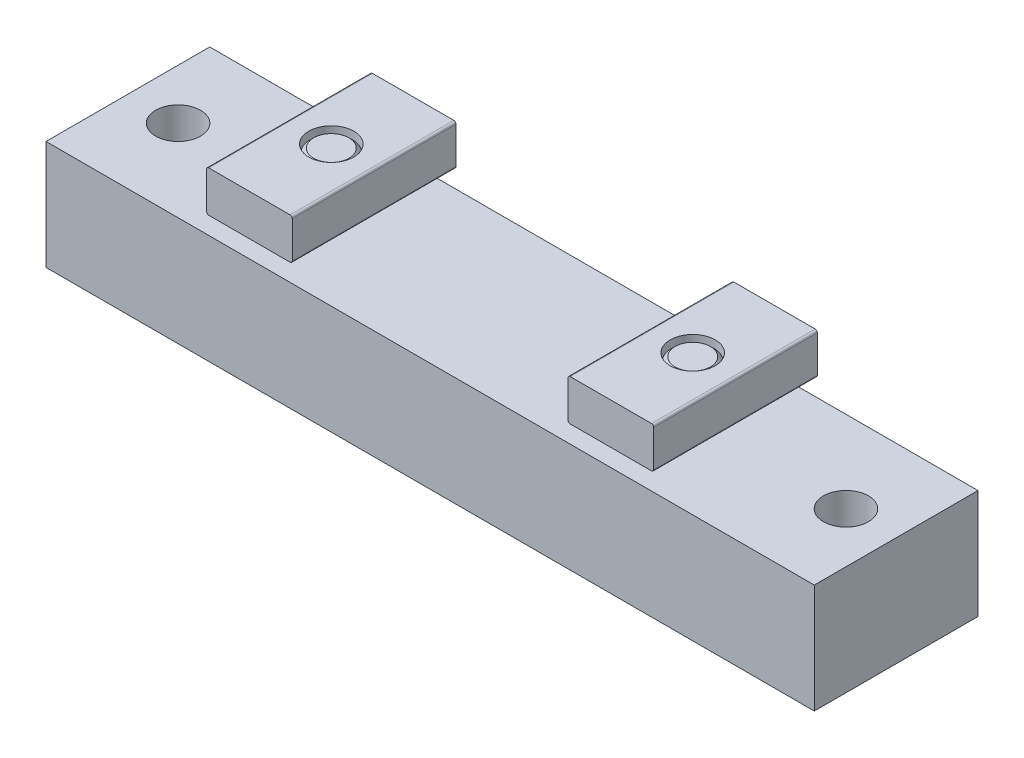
ISO-10303-21;
HEADER;
FILE_DESCRIPTION(('STEP AP214'),'2;1');
FILE_NAME('part.step','',(''),(''),'','','');
FILE_SCHEMA(('AUTOMOTIVE_DESIGN { 1 0 10303 214 1 1 1 1 }'));
ENDSEC;
DATA;
#1=APPLICATION_CONTEXT('core data for automotive mechanical design processes');
#2=APPLICATION_PROTOCOL_DEFINITION('international standard','automotive_design',2000,#1);
#3=PRODUCT_CONTEXT('',#1,'mechanical');
#4=PRODUCT('Part','Part','',(#3));
#5=PRODUCT_RELATED_PRODUCT_CATEGORY('part','',(#4));
#6=PRODUCT_DEFINITION_FORMATION('','',#4);
#7=PRODUCT_DEFINITION_CONTEXT('part definition',#1,'design');
#8=PRODUCT_DEFINITION('design','',#6,#7);
#9=PRODUCT_DEFINITION_SHAPE('','',#8);
#10=(LENGTH_UNIT() NAMED_UNIT(*) SI_UNIT(.MILLI.,.METRE.));
#11=(NAMED_UNIT(*) PLANE_ANGLE_UNIT() SI_UNIT($,.RADIAN.));
#12=(NAMED_UNIT(*) SI_UNIT($,.STERADIAN.) SOLID_ANGLE_UNIT());
#13=UNCERTAINTY_MEASURE_WITH_UNIT(LENGTH_MEASURE(1.E-05),#10,'distance_accuracy_value','');
#14=(GEOMETRIC_REPRESENTATION_CONTEXT(3) GLOBAL_UNCERTAINTY_ASSIGNED_CONTEXT((#13)) GLOBAL_UNIT_ASSIGNED_CONTEXT((#10,
#11,#12)) REPRESENTATION_CONTEXT('',''));
#15=CARTESIAN_POINT('',(0.,0.,0.));
#16=DIRECTION('',(0.,0.,1.));
#17=DIRECTION('',(1.,0.,0.));
#18=AXIS2_PLACEMENT_3D('',#15,#16,#17);
#19=CARTESIAN_POINT('',(25.76195,6.5532,9.525));
#20=DIRECTION('',(0.,0.,-1.));
#21=DIRECTION('',(0.,1.,0.));
#22=AXIS2_PLACEMENT_3D('',#19,#20,#21);
#23=CYLINDRICAL_SURFACE('',#22,0.254);
#24=CARTESIAN_POINT('',(25.76195,6.5532,-9.525));
#25=DIRECTION('',(0.,0.,1.));
#26=DIRECTION('',(0.,-1.,0.));
#27=AXIS2_PLACEMENT_3D('',#24,#25,#26);
#28=CIRCLE('',#27,0.254);
#29=CARTESIAN_POINT('',(26.01595,6.5532,-9.525));
#30=VERTEX_POINT('',#29);
#31=CARTESIAN_POINT('',(25.76195,6.8072,-9.525));
#32=VERTEX_POINT('',#31);
#33=EDGE_CURVE('P0_E83',#30,#32,#28,.T.);
#34=ORIENTED_EDGE('',*,*,#33,.T.);
#35=DIRECTION('',(0.,0.,-1.));
#36=VECTOR('',#35,1.);
#37=CARTESIAN_POINT('',(25.76195,6.8072,9.525));
#38=LINE('',#37,#36);
#39=CARTESIAN_POINT('',(25.76195,6.8072,9.525));
#40=VERTEX_POINT('',#39);
#41=EDGE_CURVE('P0_E10',#40,#32,#38,.T.);
#42=ORIENTED_EDGE('',*,*,#41,.F.);
#43=CARTESIAN_POINT('',(25.76195,6.5532,9.525));
#44=DIRECTION('',(0.,0.,1.));
#45=DIRECTION('',(0.,-1.,0.));
#46=AXIS2_PLACEMENT_3D('',#43,#44,#45);
#47=CIRCLE('',#46,0.254);
#48=CARTESIAN_POINT('',(26.01595,6.5532,9.525));
#49=VERTEX_POINT('',#48);
#50=EDGE_CURVE('P0_E115',#49,#40,#47,.T.);
#51=ORIENTED_EDGE('',*,*,#50,.F.);
#52=DIRECTION('',(0.,0.,-1.));
#53=VECTOR('',#52,1.);
#54=CARTESIAN_POINT('',(26.01595,6.5532,9.525));
#55=LINE('',#54,#53);
#56=EDGE_CURVE('P0_E96',#49,#30,#55,.T.);
#57=ORIENTED_EDGE('',*,*,#56,.T.);
#58=EDGE_LOOP('',(#34,#42,#51,#57));
#59=FACE_BOUND('',#58,.T.);
#60=ADVANCED_FACE('P0_F15',(#59),#23,.T.);
#61=CARTESIAN_POINT('',(16.30045,6.8072,9.525));
#62=DIRECTION('',(0.,-1.,0.));
#63=DIRECTION('',(0.,0.,-1.));
#64=AXIS2_PLACEMENT_3D('',#61,#62,#63);
#65=PLANE('',#64);
#66=CARTESIAN_POINT('',(21.0312,6.8072,0.));
#67=DIRECTION('',(0.,1.,0.));
#68=DIRECTION('',(0.,0.,1.));
#69=AXIS2_PLACEMENT_3D('',#66,#67,#68);
#70=CIRCLE('',#69,2.6162);
#71=CARTESIAN_POINT('',(21.0312,6.8072,2.6162));
#72=VERTEX_POINT('',#71);
#73=EDGE_CURVE('P0_E100',#72,#72,#70,.T.);
#74=ORIENTED_EDGE('',*,*,#73,.F.);
#75=EDGE_LOOP('',(#74));
#76=FACE_BOUND('',#75,.T.);
#77=DIRECTION('',(-1.,0.,0.));
#78=VECTOR('',#77,1.);
#79=CARTESIAN_POINT('',(16.30045,6.8072,-9.525));
#80=LINE('',#79,#78);
#81=CARTESIAN_POINT('',(16.30045,6.8072,-9.525));
#82=VERTEX_POINT('',#81);
#83=EDGE_CURVE('P0_E79',#32,#82,#80,.T.);
#84=ORIENTED_EDGE('',*,*,#83,.T.);
#85=DIRECTION('',(0.,0.,-1.));
#86=VECTOR('',#85,1.);
#87=CARTESIAN_POINT('',(16.30045,6.8072,9.525));
#88=LINE('',#87,#86);
#89=CARTESIAN_POINT('',(16.30045,6.8072,9.525));
#90=VERTEX_POINT('',#89);
#91=EDGE_CURVE('P0_E22',#90,#82,#88,.T.);
#92=ORIENTED_EDGE('',*,*,#91,.F.);
#93=DIRECTION('',(-1.,0.,0.));
#94=VECTOR('',#93,1.);
#95=CARTESIAN_POINT('',(16.30045,6.8072,9.525));
#96=LINE('',#95,#94);
#97=EDGE_CURVE('P0_E92',#40,#90,#96,.T.);
#98=ORIENTED_EDGE('',*,*,#97,.F.);
#99=ORIENTED_EDGE('',*,*,#41,.T.);
#100=EDGE_LOOP('',(#84,#92,#98,#99));
#101=FACE_BOUND('',#100,.T.);
#102=ADVANCED_FACE('P0_F91',(#76,#101),#65,.F.);
#103=CARTESIAN_POINT('',(16.30045,6.5532,9.525));
#104=DIRECTION('',(0.,0.,-1.));
#105=DIRECTION('',(0.,1.,0.));
#106=AXIS2_PLACEMENT_3D('',#103,#104,#105);
#107=CYLINDRICAL_SURFACE('',#106,0.254);
#108=CARTESIAN_POINT('',(16.30045,6.5532,-9.525));
#109=DIRECTION('',(0.,0.,1.));
#110=DIRECTION('',(0.,-1.,0.));
#111=AXIS2_PLACEMENT_3D('',#108,#109,#110);
#112=CIRCLE('',#111,0.254);
#113=CARTESIAN_POINT('',(16.04645,6.5532,-9.525));
#114=VERTEX_POINT('',#113);
#115=EDGE_CURVE('P0_E85',#82,#114,#112,.T.);
#116=ORIENTED_EDGE('',*,*,#115,.T.);
#117=DIRECTION('',(0.,0.,-1.));
#118=VECTOR('',#117,1.);
#119=CARTESIAN_POINT('',(16.04645,6.5532,9.525));
#120=LINE('',#119,#118);
#121=CARTESIAN_POINT('',(16.04645,6.5532,9.525));
#122=VERTEX_POINT('',#121);
#123=EDGE_CURVE('P0_E141',#122,#114,#120,.T.);
#124=ORIENTED_EDGE('',*,*,#123,.F.);
#125=CARTESIAN_POINT('',(16.30045,6.5532,9.525));
#126=DIRECTION('',(0.,0.,1.));
#127=DIRECTION('',(0.,-1.,0.));
#128=AXIS2_PLACEMENT_3D('',#125,#126,#127);
#129=CIRCLE('',#128,0.254);
#130=EDGE_CURVE('P0_E118',#90,#122,#129,.T.);
#131=ORIENTED_EDGE('',*,*,#130,.F.);
#132=ORIENTED_EDGE('',*,*,#91,.T.);
#133=EDGE_LOOP('',(#116,#124,#131,#132));
#134=FACE_BOUND('',#133,.T.);
#135=ADVANCED_FACE('P0_F145',(#134),#107,.T.);
#136=CARTESIAN_POINT('',(16.04645,6.5532,9.525));
#137=DIRECTION('',(1.,0.,0.));
#138=DIRECTION('',(0.,0.,1.));
#139=AXIS2_PLACEMENT_3D('',#136,#137,#138);
#140=PLANE('',#139);
#141=DIRECTION('',(0.,-1.,0.));
#142=VECTOR('',#141,1.);
#143=CARTESIAN_POINT('',(16.04645,6.5532,-9.525));
#144=LINE('',#143,#142);
#145=CARTESIAN_POINT('',(16.04645,2.286,-9.525));
#146=VERTEX_POINT('',#145);
#147=EDGE_CURVE('P0_E105',#114,#146,#144,.T.);
#148=ORIENTED_EDGE('',*,*,#147,.T.);
#149=DIRECTION('',(0.,0.,-1.));
#150=VECTOR('',#149,1.);
#151=CARTESIAN_POINT('',(16.04645,2.286,9.525));
#152=LINE('',#151,#150);
#153=CARTESIAN_POINT('',(16.04645,2.286,9.525));
#154=VERTEX_POINT('',#153);
#155=EDGE_CURVE('P0_E138',#154,#146,#152,.T.);
#156=ORIENTED_EDGE('',*,*,#155,.F.);
#157=DIRECTION('',(0.,-1.,0.));
#158=VECTOR('',#157,1.);
#159=CARTESIAN_POINT('',(16.04645,6.5532,9.525));
#160=LINE('',#159,#158);
#161=EDGE_CURVE('P0_E120',#122,#154,#160,.T.);
#162=ORIENTED_EDGE('',*,*,#161,.F.);
#163=ORIENTED_EDGE('',*,*,#123,.T.);
#164=EDGE_LOOP('',(#148,#156,#162,#163));
#165=FACE_BOUND('',#164,.T.);
#166=ADVANCED_FACE('P0_F153',(#165),#140,.F.);
#167=CARTESIAN_POINT('',(16.30045,2.286,9.525));
#168=DIRECTION('',(0.,0.,-1.));
#169=DIRECTION('',(0.,1.,0.));
#170=AXIS2_PLACEMENT_3D('',#167,#168,#169);
#171=CYLINDRICAL_SURFACE('',#170,0.254);
#172=CARTESIAN_POINT('',(16.30045,2.286,-9.525));
#173=DIRECTION('',(0.,0.,1.));
#174=DIRECTION('',(0.,-1.,0.));
#175=AXIS2_PLACEMENT_3D('',#172,#173,#174);
#176=CIRCLE('',#175,0.254);
#177=CARTESIAN_POINT('',(16.30045,2.032,-9.525));
#178=VERTEX_POINT('',#177);
#179=EDGE_CURVE('P0_E107',#146,#178,#176,.T.);
#180=ORIENTED_EDGE('',*,*,#179,.T.);
#181=DIRECTION('',(0.,0.,-1.));
#182=VECTOR('',#181,1.);
#183=CARTESIAN_POINT('',(16.30045,2.032,9.525));
#184=LINE('',#183,#182);
#185=CARTESIAN_POINT('',(16.30045,2.032,9.525));
#186=VERTEX_POINT('',#185);
#187=EDGE_CURVE('P0_E135',#186,#178,#184,.T.);
#188=ORIENTED_EDGE('',*,*,#187,.F.);
#189=CARTESIAN_POINT('',(16.30045,2.286,9.525));
#190=DIRECTION('',(0.,0.,1.));
#191=DIRECTION('',(0.,-1.,0.));
#192=AXIS2_PLACEMENT_3D('',#189,#190,#191);
#193=CIRCLE('',#192,0.254);
#194=EDGE_CURVE('P0_E122',#154,#186,#193,.T.);
#195=ORIENTED_EDGE('',*,*,#194,.F.);
#196=ORIENTED_EDGE('',*,*,#155,.T.);
#197=EDGE_LOOP('',(#180,#188,#195,#196));
#198=FACE_BOUND('',#197,.T.);
#199=ADVANCED_FACE('P0_F156',(#198),#171,.T.);
#200=CARTESIAN_POINT('',(16.30045,2.032,9.525));
#201=DIRECTION('',(0.,1.,0.));
#202=DIRECTION('',(0.,0.,1.));
#203=AXIS2_PLACEMENT_3D('',#200,#201,#202);
#204=PLANE('',#203);
#205=CARTESIAN_POINT('',(21.0312,2.032,0.));
#206=DIRECTION('',(0.,1.,0.));
#207=DIRECTION('',(0.,0.,1.));
#208=AXIS2_PLACEMENT_3D('',#205,#206,#207);
#209=CIRCLE('',#208,2.6162);
#210=CARTESIAN_POINT('',(21.0312,2.032,2.6162));
#211=VERTEX_POINT('',#210);
#212=EDGE_CURVE('P0_E97',#211,#211,#209,.T.);
#213=ORIENTED_EDGE('',*,*,#212,.T.);
#214=EDGE_LOOP('',(#213));
#215=FACE_BOUND('',#214,.T.);
#216=DIRECTION('',(1.,0.,0.));
#217=VECTOR('',#216,1.);
#218=CARTESIAN_POINT('',(16.30045,2.032,-9.525));
#219=LINE('',#218,#217);
#220=CARTESIAN_POINT('',(25.76195,2.032,-9.525));
#221=VERTEX_POINT('',#220);
#222=EDGE_CURVE('P0_E109',#178,#221,#219,.T.);
#223=ORIENTED_EDGE('',*,*,#222,.T.);
#224=DIRECTION('',(0.,0.,-1.));
#225=VECTOR('',#224,1.);
#226=CARTESIAN_POINT('',(25.76195,2.032,9.525));
#227=LINE('',#226,#225);
#228=CARTESIAN_POINT('',(25.76195,2.032,9.525));
#229=VERTEX_POINT('',#228);
#230=EDGE_CURVE('P0_E132',#229,#221,#227,.T.);
#231=ORIENTED_EDGE('',*,*,#230,.F.);
#232=DIRECTION('',(1.,0.,0.));
#233=VECTOR('',#232,1.);
#234=CARTESIAN_POINT('',(16.30045,2.032,9.525));
#235=LINE('',#234,#233);
#236=EDGE_CURVE('P0_E124',#186,#229,#235,.T.);
#237=ORIENTED_EDGE('',*,*,#236,.F.);
#238=ORIENTED_EDGE('',*,*,#187,.T.);
#239=EDGE_LOOP('',(#223,#231,#237,#238));
#240=FACE_BOUND('',#239,.T.);
#241=ADVANCED_FACE('P0_F161',(#215,#240),#204,.F.);
#242=CARTESIAN_POINT('',(25.76195,2.286,9.525));
#243=DIRECTION('',(0.,0.,-1.));
#244=DIRECTION('',(0.,1.,0.));
#245=AXIS2_PLACEMENT_3D('',#242,#243,#244);
#246=CYLINDRICAL_SURFACE('',#245,0.254);
#247=CARTESIAN_POINT('',(25.76195,2.286,-9.525));
#248=DIRECTION('',(0.,0.,1.));
#249=DIRECTION('',(0.,-1.,0.));
#250=AXIS2_PLACEMENT_3D('',#247,#248,#249);
#251=CIRCLE('',#250,0.254);
#252=CARTESIAN_POINT('',(26.01595,2.286,-9.525));
#253=VERTEX_POINT('',#252);
#254=EDGE_CURVE('P0_E111',#221,#253,#251,.T.);
#255=ORIENTED_EDGE('',*,*,#254,.T.);
#256=DIRECTION('',(0.,0.,-1.));
#257=VECTOR('',#256,1.);
#258=CARTESIAN_POINT('',(26.01595,2.286,9.525));
#259=LINE('',#258,#257);
#260=CARTESIAN_POINT('',(26.01595,2.286,9.525));
#261=VERTEX_POINT('',#260);
#262=EDGE_CURVE('P0_E129',#261,#253,#259,.T.);
#263=ORIENTED_EDGE('',*,*,#262,.F.);
#264=CARTESIAN_POINT('',(25.76195,2.286,9.525));
#265=DIRECTION('',(0.,0.,1.));
#266=DIRECTION('',(0.,-1.,0.));
#267=AXIS2_PLACEMENT_3D('',#264,#265,#266);
#268=CIRCLE('',#267,0.254);
#269=EDGE_CURVE('P0_E34',#229,#261,#268,.T.);
#270=ORIENTED_EDGE('',*,*,#269,.F.);
#271=ORIENTED_EDGE('',*,*,#230,.T.);
#272=EDGE_LOOP('',(#255,#263,#270,#271));
#273=FACE_BOUND('',#272,.T.);
#274=ADVANCED_FACE('P0_F164',(#273),#246,.T.);
#275=CARTESIAN_POINT('',(26.01595,6.5532,9.525));
#276=DIRECTION('',(-1.,0.,0.));
#277=DIRECTION('',(0.,-1.,0.));
#278=AXIS2_PLACEMENT_3D('',#275,#276,#277);
#279=PLANE('',#278);
#280=DIRECTION('',(0.,1.,0.));
#281=VECTOR('',#280,1.);
#282=CARTESIAN_POINT('',(26.01595,6.5532,-9.525));
#283=LINE('',#282,#281);
#284=EDGE_CURVE('P0_E113',#253,#30,#283,.T.);
#285=ORIENTED_EDGE('',*,*,#284,.T.);
#286=ORIENTED_EDGE('',*,*,#56,.F.);
#287=DIRECTION('',(0.,1.,0.));
#288=VECTOR('',#287,1.);
#289=CARTESIAN_POINT('',(26.01595,6.5532,9.525));
#290=LINE('',#289,#288);
#291=EDGE_CURVE('P0_E29',#261,#49,#290,.T.);
#292=ORIENTED_EDGE('',*,*,#291,.F.);
#293=ORIENTED_EDGE('',*,*,#262,.T.);
#294=EDGE_LOOP('',(#285,#286,#292,#293));
#295=FACE_BOUND('',#294,.T.);
#296=ADVANCED_FACE('P0_F166',(#295),#279,.F.);
#297=CARTESIAN_POINT('',(25.76195,6.5532,9.525));
#298=DIRECTION('',(0.,0.,1.));
#299=DIRECTION('',(0.,-1.,0.));
#300=AXIS2_PLACEMENT_3D('',#297,#298,#299);
#301=PLANE('',#300);
#302=ORIENTED_EDGE('',*,*,#50,.T.);
#303=ORIENTED_EDGE('',*,*,#97,.T.);
#304=ORIENTED_EDGE('',*,*,#130,.T.);
#305=ORIENTED_EDGE('',*,*,#161,.T.);
#306=ORIENTED_EDGE('',*,*,#194,.T.);
#307=ORIENTED_EDGE('',*,*,#236,.T.);
#308=ORIENTED_EDGE('',*,*,#269,.T.);
#309=ORIENTED_EDGE('',*,*,#291,.T.);
#310=EDGE_LOOP('',(#302,#303,#304,#305,#306,#307,#308,#309));
#311=FACE_BOUND('',#310,.T.);
#312=ADVANCED_FACE('P0_F148',(#311),#301,.T.);
#313=CARTESIAN_POINT('',(25.76195,6.5532,-9.525));
#314=DIRECTION('',(0.,0.,1.));
#315=DIRECTION('',(0.,-1.,0.));
#316=AXIS2_PLACEMENT_3D('',#313,#314,#315);
#317=PLANE('',#316);
#318=ORIENTED_EDGE('',*,*,#33,.F.);
#319=ORIENTED_EDGE('',*,*,#284,.F.);
#320=ORIENTED_EDGE('',*,*,#254,.F.);
#321=ORIENTED_EDGE('',*,*,#222,.F.);
#322=ORIENTED_EDGE('',*,*,#179,.F.);
#323=ORIENTED_EDGE('',*,*,#147,.F.);
#324=ORIENTED_EDGE('',*,*,#115,.F.);
#325=ORIENTED_EDGE('',*,*,#83,.F.);
#326=EDGE_LOOP('',(#318,#319,#320,#321,#322,#323,#324,#325));
#327=FACE_BOUND('',#326,.T.);
#328=ADVANCED_FACE('P0_F80',(#327),#317,.F.);
#329=CARTESIAN_POINT('',(21.0312,2.032,0.));
#330=DIRECTION('',(0.,1.,0.));
#331=DIRECTION('',(0.,0.,1.));
#332=AXIS2_PLACEMENT_3D('',#329,#330,#331);
#333=CYLINDRICAL_SURFACE('',#332,2.6162);
#334=ORIENTED_EDGE('',*,*,#212,.F.);
#335=EDGE_LOOP('',(#334));
#336=FACE_BOUND('',#335,.T.);
#337=ORIENTED_EDGE('',*,*,#73,.T.);
#338=EDGE_LOOP('',(#337));
#339=FACE_BOUND('',#338,.T.);
#340=ADVANCED_FACE('P0_F197',(#336,#339),#333,.F.);
#341=CLOSED_SHELL('',(#60,#102,#135,#166,#199,#241,#274,#296,#312,#328,#340));
#342=MANIFOLD_SOLID_BREP('P0_B1',#341);
#343=CARTESIAN_POINT('',(-16.30045,6.5532,9.525));
#344=DIRECTION('',(0.,0.,-1.));
#345=DIRECTION('',(0.,1.,0.));
#346=AXIS2_PLACEMENT_3D('',#343,#344,#345);
#347=CYLINDRICAL_SURFACE('',#346,0.254);
#348=CARTESIAN_POINT('',(-16.30045,6.5532,-9.525));
#349=DIRECTION('',(0.,0.,1.));
#350=DIRECTION('',(0.,-1.,0.));
#351=AXIS2_PLACEMENT_3D('',#348,#349,#350);
#352=CIRCLE('',#351,0.254);
#353=CARTESIAN_POINT('',(-16.04645,6.5532,-9.525));
#354=VERTEX_POINT('',#353);
#355=CARTESIAN_POINT('',(-16.30045,6.8072,-9.525));
#356=VERTEX_POINT('',#355);
#357=EDGE_CURVE('P1_E121',#354,#356,#352,.T.);
#358=ORIENTED_EDGE('',*,*,#357,.T.);
#359=DIRECTION('',(0.,0.,-1.));
#360=VECTOR('',#359,1.);
#361=CARTESIAN_POINT('',(-16.30045,6.8072,9.525));
#362=LINE('',#361,#360);
#363=CARTESIAN_POINT('',(-16.30045,6.8072,9.525));
#364=VERTEX_POINT('',#363);
#365=EDGE_CURVE('P1_E102',#364,#356,#362,.T.);
#366=ORIENTED_EDGE('',*,*,#365,.F.);
#367=CARTESIAN_POINT('',(-16.30045,6.5532,9.525));
#368=DIRECTION('',(0.,0.,1.));
#369=DIRECTION('',(0.,-1.,0.));
#370=AXIS2_PLACEMENT_3D('',#367,#368,#369);
#371=CIRCLE('',#370,0.254);
#372=CARTESIAN_POINT('',(-16.04645,6.5532,9.525));
#373=VERTEX_POINT('',#372);
#374=EDGE_CURVE('P1_E85',#373,#364,#371,.T.);
#375=ORIENTED_EDGE('',*,*,#374,.F.);
#376=DIRECTION('',(0.,0.,-1.));
#377=VECTOR('',#376,1.);
#378=CARTESIAN_POINT('',(-16.04645,6.5532,9.525));
#379=LINE('',#378,#377);
#380=EDGE_CURVE('P1_E92',#373,#354,#379,.T.);
#381=ORIENTED_EDGE('',*,*,#380,.T.);
#382=EDGE_LOOP('',(#358,#366,#375,#381));
#383=FACE_BOUND('',#382,.T.);
#384=ADVANCED_FACE('P1_F16',(#383),#347,.T.);
#385=CARTESIAN_POINT('',(-25.76195,6.8072,9.525));
#386=DIRECTION('',(0.,-1.,0.));
#387=DIRECTION('',(0.,0.,-1.));
#388=AXIS2_PLACEMENT_3D('',#385,#386,#387);
#389=PLANE('',#388);
#390=CARTESIAN_POINT('',(-21.0312,6.8072,0.));
#391=DIRECTION('',(0.,1.,0.));
#392=DIRECTION('',(0.,0.,1.));
#393=AXIS2_PLACEMENT_3D('',#390,#391,#392);
#394=CIRCLE('',#393,2.6162);
#395=CARTESIAN_POINT('',(-21.0312,6.8072,2.6162));
#396=VERTEX_POINT('',#395);
#397=EDGE_CURVE('P1_E11',#396,#396,#394,.T.);
#398=ORIENTED_EDGE('',*,*,#397,.F.);
#399=EDGE_LOOP('',(#398));
#400=FACE_BOUND('',#399,.T.);
#401=DIRECTION('',(-1.,0.,0.));
#402=VECTOR('',#401,1.);
#403=CARTESIAN_POINT('',(-25.76195,6.8072,-9.525));
#404=LINE('',#403,#402);
#405=CARTESIAN_POINT('',(-25.76195,6.8072,-9.525));
#406=VERTEX_POINT('',#405);
#407=EDGE_CURVE('P1_E31',#356,#406,#404,.T.);
#408=ORIENTED_EDGE('',*,*,#407,.T.);
#409=DIRECTION('',(0.,0.,-1.));
#410=VECTOR('',#409,1.);
#411=CARTESIAN_POINT('',(-25.76195,6.8072,9.525));
#412=LINE('',#411,#410);
#413=CARTESIAN_POINT('',(-25.76195,6.8072,9.525));
#414=VERTEX_POINT('',#413);
#415=EDGE_CURVE('P1_E191',#414,#406,#412,.T.);
#416=ORIENTED_EDGE('',*,*,#415,.F.);
#417=DIRECTION('',(-1.,0.,0.));
#418=VECTOR('',#417,1.);
#419=CARTESIAN_POINT('',(-25.76195,6.8072,9.525));
#420=LINE('',#419,#418);
#421=EDGE_CURVE('P1_E103',#364,#414,#420,.T.);
#422=ORIENTED_EDGE('',*,*,#421,.F.);
#423=ORIENTED_EDGE('',*,*,#365,.T.);
#424=EDGE_LOOP('',(#408,#416,#422,#423));
#425=FACE_BOUND('',#424,.T.);
#426=ADVANCED_FACE('P1_F133',(#400,#425),#389,.F.);
#427=CARTESIAN_POINT('',(-25.76195,6.5532,9.525));
#428=DIRECTION('',(0.,0.,-1.));
#429=DIRECTION('',(0.,1.,0.));
#430=AXIS2_PLACEMENT_3D('',#427,#428,#429);
#431=CYLINDRICAL_SURFACE('',#430,0.254);
#432=CARTESIAN_POINT('',(-25.76195,6.5532,-9.525));
#433=DIRECTION('',(0.,0.,1.));
#434=DIRECTION('',(0.,-1.,0.));
#435=AXIS2_PLACEMENT_3D('',#432,#433,#434);
#436=CIRCLE('',#435,0.254);
#437=CARTESIAN_POINT('',(-26.01595,6.5532,-9.525));
#438=VERTEX_POINT('',#437);
#439=EDGE_CURVE('P1_E118',#406,#438,#436,.T.);
#440=ORIENTED_EDGE('',*,*,#439,.T.);
#441=DIRECTION('',(0.,0.,-1.));
#442=VECTOR('',#441,1.);
#443=CARTESIAN_POINT('',(-26.01595,6.5532,9.525));
#444=LINE('',#443,#442);
#445=CARTESIAN_POINT('',(-26.01595,6.5532,9.525));
#446=VERTEX_POINT('',#445);
#447=EDGE_CURVE('P1_E188',#446,#438,#444,.T.);
#448=ORIENTED_EDGE('',*,*,#447,.F.);
#449=CARTESIAN_POINT('',(-25.76195,6.5532,9.525));
#450=DIRECTION('',(0.,0.,1.));
#451=DIRECTION('',(0.,-1.,0.));
#452=AXIS2_PLACEMENT_3D('',#449,#450,#451);
#453=CIRCLE('',#452,0.254);
#454=EDGE_CURVE('P1_E107',#414,#446,#453,.T.);
#455=ORIENTED_EDGE('',*,*,#454,.F.);
#456=ORIENTED_EDGE('',*,*,#415,.T.);
#457=EDGE_LOOP('',(#440,#448,#455,#456));
#458=FACE_BOUND('',#457,.T.);
#459=ADVANCED_FACE('P1_F135',(#458),#431,.T.);
#460=CARTESIAN_POINT('',(-26.01595,6.5532,9.525));
#461=DIRECTION('',(1.,0.,0.));
#462=DIRECTION('',(0.,0.,1.));
#463=AXIS2_PLACEMENT_3D('',#460,#461,#462);
#464=PLANE('',#463);
#465=DIRECTION('',(0.,-1.,0.));
#466=VECTOR('',#465,1.);
#467=CARTESIAN_POINT('',(-26.01595,6.5532,-9.525));
#468=LINE('',#467,#466);
#469=CARTESIAN_POINT('',(-26.01595,2.286,-9.525));
#470=VERTEX_POINT('',#469);
#471=EDGE_CURVE('P1_E116',#438,#470,#468,.T.);
#472=ORIENTED_EDGE('',*,*,#471,.T.);
#473=DIRECTION('',(0.,0.,-1.));
#474=VECTOR('',#473,1.);
#475=CARTESIAN_POINT('',(-26.01595,2.286,9.525));
#476=LINE('',#475,#474);
#477=CARTESIAN_POINT('',(-26.01595,2.286,9.525));
#478=VERTEX_POINT('',#477);
#479=EDGE_CURVE('P1_E190',#478,#470,#476,.T.);
#480=ORIENTED_EDGE('',*,*,#479,.F.);
#481=DIRECTION('',(0.,-1.,0.));
#482=VECTOR('',#481,1.);
#483=CARTESIAN_POINT('',(-26.01595,6.5532,9.525));
#484=LINE('',#483,#482);
#485=EDGE_CURVE('P1_E182',#446,#478,#484,.T.);
#486=ORIENTED_EDGE('',*,*,#485,.F.);
#487=ORIENTED_EDGE('',*,*,#447,.T.);
#488=EDGE_LOOP('',(#472,#480,#486,#487));
#489=FACE_BOUND('',#488,.T.);
#490=ADVANCED_FACE('P1_F142',(#489),#464,.F.);
#491=CARTESIAN_POINT('',(-25.76195,2.286,9.525));
#492=DIRECTION('',(0.,0.,-1.));
#493=DIRECTION('',(0.,1.,0.));
#494=AXIS2_PLACEMENT_3D('',#491,#492,#493);
#495=CYLINDRICAL_SURFACE('',#494,0.254);
#496=CARTESIAN_POINT('',(-25.76195,2.286,-9.525));
#497=DIRECTION('',(0.,0.,1.));
#498=DIRECTION('',(0.,-1.,0.));
#499=AXIS2_PLACEMENT_3D('',#496,#497,#498);
#500=CIRCLE('',#499,0.254);
#501=CARTESIAN_POINT('',(-25.76195,2.032,-9.525));
#502=VERTEX_POINT('',#501);
#503=EDGE_CURVE('P1_E114',#470,#502,#500,.T.);
#504=ORIENTED_EDGE('',*,*,#503,.T.);
#505=DIRECTION('',(0.,0.,-1.));
#506=VECTOR('',#505,1.);
#507=CARTESIAN_POINT('',(-25.76195,2.032,9.525));
#508=LINE('',#507,#506);
#509=CARTESIAN_POINT('',(-25.76195,2.032,9.525));
#510=VERTEX_POINT('',#509);
#511=EDGE_CURVE('P1_E173',#510,#502,#508,.T.);
#512=ORIENTED_EDGE('',*,*,#511,.F.);
#513=CARTESIAN_POINT('',(-25.76195,2.286,9.525));
#514=DIRECTION('',(0.,0.,1.));
#515=DIRECTION('',(0.,-1.,0.));
#516=AXIS2_PLACEMENT_3D('',#513,#514,#515);
#517=CIRCLE('',#516,0.254);
#518=EDGE_CURVE('P1_E180',#478,#510,#517,.T.);
#519=ORIENTED_EDGE('',*,*,#518,.F.);
#520=ORIENTED_EDGE('',*,*,#479,.T.);
#521=EDGE_LOOP('',(#504,#512,#519,#520));
#522=FACE_BOUND('',#521,.T.);
#523=ADVANCED_FACE('P1_F149',(#522),#495,.T.);
#524=CARTESIAN_POINT('',(-25.76195,2.032,9.525));
#525=DIRECTION('',(0.,1.,0.));
#526=DIRECTION('',(0.,0.,1.));
#527=AXIS2_PLACEMENT_3D('',#524,#525,#526);
#528=PLANE('',#527);
#529=CARTESIAN_POINT('',(-21.0312,2.032,0.));
#530=DIRECTION('',(0.,1.,0.));
#531=DIRECTION('',(0.,0.,1.));
#532=AXIS2_PLACEMENT_3D('',#529,#530,#531);
#533=CIRCLE('',#532,2.6162);
#534=CARTESIAN_POINT('',(-21.0312,2.032,2.6162));
#535=VERTEX_POINT('',#534);
#536=EDGE_CURVE('P1_E24',#535,#535,#533,.T.);
#537=ORIENTED_EDGE('',*,*,#536,.T.);
#538=EDGE_LOOP('',(#537));
#539=FACE_BOUND('',#538,.T.);
#540=DIRECTION('',(1.,0.,0.));
#541=VECTOR('',#540,1.);
#542=CARTESIAN_POINT('',(-25.76195,2.032,-9.525));
#543=LINE('',#542,#541);
#544=CARTESIAN_POINT('',(-16.30045,2.032,-9.525));
#545=VERTEX_POINT('',#544);
#546=EDGE_CURVE('P1_E112',#502,#545,#543,.T.);
#547=ORIENTED_EDGE('',*,*,#546,.T.);
#548=DIRECTION('',(0.,0.,-1.));
#549=VECTOR('',#548,1.);
#550=CARTESIAN_POINT('',(-16.30045,2.032,9.525));
#551=LINE('',#550,#549);
#552=CARTESIAN_POINT('',(-16.30045,2.032,9.525));
#553=VERTEX_POINT('',#552);
#554=EDGE_CURVE('P1_E171',#553,#545,#551,.T.);
#555=ORIENTED_EDGE('',*,*,#554,.F.);
#556=DIRECTION('',(1.,0.,0.));
#557=VECTOR('',#556,1.);
#558=CARTESIAN_POINT('',(-25.76195,2.032,9.525));
#559=LINE('',#558,#557);
#560=EDGE_CURVE('P1_E178',#510,#553,#559,.T.);
#561=ORIENTED_EDGE('',*,*,#560,.F.);
#562=ORIENTED_EDGE('',*,*,#511,.T.);
#563=EDGE_LOOP('',(#547,#555,#561,#562));
#564=FACE_BOUND('',#563,.T.);
#565=ADVANCED_FACE('P1_F125',(#539,#564),#528,.F.);
#566=CARTESIAN_POINT('',(-16.30045,2.286,9.525));
#567=DIRECTION('',(0.,0.,-1.));
#568=DIRECTION('',(0.,1.,0.));
#569=AXIS2_PLACEMENT_3D('',#566,#567,#568);
#570=CYLINDRICAL_SURFACE('',#569,0.254);
#571=CARTESIAN_POINT('',(-16.30045,2.286,-9.525));
#572=DIRECTION('',(0.,0.,1.));
#573=DIRECTION('',(0.,-1.,0.));
#574=AXIS2_PLACEMENT_3D('',#571,#572,#573);
#575=CIRCLE('',#574,0.254);
#576=CARTESIAN_POINT('',(-16.04645,2.286,-9.525));
#577=VERTEX_POINT('',#576);
#578=EDGE_CURVE('P1_E105',#545,#577,#575,.T.);
#579=ORIENTED_EDGE('',*,*,#578,.T.);
#580=DIRECTION('',(0.,0.,-1.));
#581=VECTOR('',#580,1.);
#582=CARTESIAN_POINT('',(-16.04645,2.286,9.525));
#583=LINE('',#582,#581);
#584=CARTESIAN_POINT('',(-16.04645,2.286,9.525));
#585=VERTEX_POINT('',#584);
#586=EDGE_CURVE('P1_E100',#585,#577,#583,.T.);
#587=ORIENTED_EDGE('',*,*,#586,.F.);
#588=CARTESIAN_POINT('',(-16.30045,2.286,9.525));
#589=DIRECTION('',(0.,0.,1.));
#590=DIRECTION('',(0.,-1.,0.));
#591=AXIS2_PLACEMENT_3D('',#588,#589,#590);
#592=CIRCLE('',#591,0.254);
#593=EDGE_CURVE('P1_E88',#553,#585,#592,.T.);
#594=ORIENTED_EDGE('',*,*,#593,.F.);
#595=ORIENTED_EDGE('',*,*,#554,.T.);
#596=EDGE_LOOP('',(#579,#587,#594,#595));
#597=FACE_BOUND('',#596,.T.);
#598=ADVANCED_FACE('P1_F156',(#597),#570,.T.);
#599=CARTESIAN_POINT('',(-16.04645,6.5532,9.525));
#600=DIRECTION('',(-1.,0.,0.));
#601=DIRECTION('',(0.,-1.,0.));
#602=AXIS2_PLACEMENT_3D('',#599,#600,#601);
#603=PLANE('',#602);
#604=DIRECTION('',(0.,1.,0.));
#605=VECTOR('',#604,1.);
#606=CARTESIAN_POINT('',(-16.04645,6.5532,-9.525));
#607=LINE('',#606,#605);
#608=EDGE_CURVE('P1_E97',#577,#354,#607,.T.);
#609=ORIENTED_EDGE('',*,*,#608,.T.);
#610=ORIENTED_EDGE('',*,*,#380,.F.);
#611=DIRECTION('',(0.,1.,0.));
#612=VECTOR('',#611,1.);
#613=CARTESIAN_POINT('',(-16.04645,6.5532,9.525));
#614=LINE('',#613,#612);
#615=EDGE_CURVE('P1_E81',#585,#373,#614,.T.);
#616=ORIENTED_EDGE('',*,*,#615,.F.);
#617=ORIENTED_EDGE('',*,*,#586,.T.);
#618=EDGE_LOOP('',(#609,#610,#616,#617));
#619=FACE_BOUND('',#618,.T.);
#620=ADVANCED_FACE('P1_F95',(#619),#603,.F.);
#621=CARTESIAN_POINT('',(-16.30045,6.5532,9.525));
#622=DIRECTION('',(0.,0.,1.));
#623=DIRECTION('',(0.,-1.,0.));
#624=AXIS2_PLACEMENT_3D('',#621,#622,#623);
#625=PLANE('',#624);
#626=ORIENTED_EDGE('',*,*,#374,.T.);
#627=ORIENTED_EDGE('',*,*,#421,.T.);
#628=ORIENTED_EDGE('',*,*,#454,.T.);
#629=ORIENTED_EDGE('',*,*,#485,.T.);
#630=ORIENTED_EDGE('',*,*,#518,.T.);
#631=ORIENTED_EDGE('',*,*,#560,.T.);
#632=ORIENTED_EDGE('',*,*,#593,.T.);
#633=ORIENTED_EDGE('',*,*,#615,.T.);
#634=EDGE_LOOP('',(#626,#627,#628,#629,#630,#631,#632,#633));
#635=FACE_BOUND('',#634,.T.);
#636=ADVANCED_FACE('P1_F83',(#635),#625,.T.);
#637=CARTESIAN_POINT('',(-16.30045,6.5532,-9.525));
#638=DIRECTION('',(0.,0.,1.));
#639=DIRECTION('',(0.,-1.,0.));
#640=AXIS2_PLACEMENT_3D('',#637,#638,#639);
#641=PLANE('',#640);
#642=ORIENTED_EDGE('',*,*,#357,.F.);
#643=ORIENTED_EDGE('',*,*,#608,.F.);
#644=ORIENTED_EDGE('',*,*,#578,.F.);
#645=ORIENTED_EDGE('',*,*,#546,.F.);
#646=ORIENTED_EDGE('',*,*,#503,.F.);
#647=ORIENTED_EDGE('',*,*,#471,.F.);
#648=ORIENTED_EDGE('',*,*,#439,.F.);
#649=ORIENTED_EDGE('',*,*,#407,.F.);
#650=EDGE_LOOP('',(#642,#643,#644,#645,#646,#647,#648,#649));
#651=FACE_BOUND('',#650,.T.);
#652=ADVANCED_FACE('P1_F130',(#651),#641,.F.);
#653=CARTESIAN_POINT('',(-21.0312,2.032,0.));
#654=DIRECTION('',(0.,1.,0.));
#655=DIRECTION('',(0.,0.,1.));
#656=AXIS2_PLACEMENT_3D('',#653,#654,#655);
#657=CYLINDRICAL_SURFACE('',#656,2.6162);
#658=ORIENTED_EDGE('',*,*,#536,.F.);
#659=EDGE_LOOP('',(#658));
#660=FACE_BOUND('',#659,.T.);
#661=ORIENTED_EDGE('',*,*,#397,.T.);
#662=EDGE_LOOP('',(#661));
#663=FACE_BOUND('',#662,.T.);
#664=ADVANCED_FACE('P1_F18',(#660,#663),#657,.F.);
#665=CLOSED_SHELL('',(#384,#426,#459,#490,#523,#565,#598,#620,#636,#652,#664));
#666=MANIFOLD_SOLID_BREP('P1_B1',#665);
#667=CARTESIAN_POINT('',(23.0787000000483,-8.088,-3.54637402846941));
#668=DIRECTION('',(0.,1.,0.));
#669=DIRECTION('',(0.,0.,-1.));
#670=AXIS2_PLACEMENT_3D('',#667,#668,#669);
#671=PLANE('',#670);
#672=DIRECTION('',(-1.02066133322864E-11,0.,1.));
#673=VECTOR('',#672,1.);
#674=CARTESIAN_POINT('',(23.0787000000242,-8.088,-1.1821246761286));
#675=LINE('',#674,#673);
#676=CARTESIAN_POINT('',(23.0787000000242,-8.088,-1.1821246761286));
#677=VERTEX_POINT('',#676);
#678=CARTESIAN_POINT('',(23.0787,-8.088,1.1821246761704));
#679=VERTEX_POINT('',#678);
#680=EDGE_CURVE('P2_E288',#677,#679,#675,.T.);
#681=ORIENTED_EDGE('',*,*,#680,.T.);
#682=DIRECTION('',(-0.86602540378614,0.,0.499999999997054));
#683=VECTOR('',#682,1.);
#684=CARTESIAN_POINT('',(23.0787,-8.088,1.1821246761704));
#685=LINE('',#684,#683);
#686=CARTESIAN_POINT('',(21.031199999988,-8.088,2.36424935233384));
#687=VERTEX_POINT('',#686);
#688=EDGE_CURVE('P2_E285',#679,#687,#685,.T.);
#689=ORIENTED_EDGE('',*,*,#688,.T.);
#690=DIRECTION('',(-0.866025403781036,0.,-0.500000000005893));
#691=VECTOR('',#690,1.);
#692=CARTESIAN_POINT('',(21.031199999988,-8.088,2.36424935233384));
#693=LINE('',#692,#691);
#694=CARTESIAN_POINT('',(18.9836999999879,-8.088,1.1821246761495));
#695=VERTEX_POINT('',#694);
#696=EDGE_CURVE('P2_E282',#687,#695,#693,.T.);
#697=ORIENTED_EDGE('',*,*,#696,.T.);
#698=DIRECTION('',(1.02066133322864E-11,0.,-1.));
#699=VECTOR('',#698,1.);
#700=CARTESIAN_POINT('',(18.9836999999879,-8.088,1.1821246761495));
#701=LINE('',#700,#699);
#702=CARTESIAN_POINT('',(18.983700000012,-8.088,-1.1821246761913));
#703=VERTEX_POINT('',#702);
#704=EDGE_CURVE('P2_E279',#695,#703,#701,.T.);
#705=ORIENTED_EDGE('',*,*,#704,.T.);
#706=DIRECTION('',(0.866025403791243,0.,-0.499999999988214));
#707=VECTOR('',#706,1.);
#708=CARTESIAN_POINT('',(18.983700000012,-8.088,-1.1821246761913));
#709=LINE('',#708,#707);
#710=CARTESIAN_POINT('',(21.0312000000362,-8.088,-2.36424935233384));
#711=VERTEX_POINT('',#710);
#712=EDGE_CURVE('P2_E276',#703,#711,#709,.T.);
#713=ORIENTED_EDGE('',*,*,#712,.T.);
#714=DIRECTION('',(0.866025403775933,0.,0.500000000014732));
#715=VECTOR('',#714,1.);
#716=CARTESIAN_POINT('',(21.0312000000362,-8.088,-2.36424935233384));
#717=LINE('',#716,#715);
#718=EDGE_CURVE('P2_E262',#711,#677,#717,.T.);
#719=ORIENTED_EDGE('',*,*,#718,.T.);
#720=EDGE_LOOP('',(#681,#689,#697,#705,#713,#719));
#721=FACE_BOUND('',#720,.T.);
#722=ADVANCED_FACE('P2_F15',(#721),#671,.F.);
#723=CARTESIAN_POINT('',(23.0787,-8.088,1.1821246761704));
#724=DIRECTION('',(0.499999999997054,0.,0.86602540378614));
#725=DIRECTION('',(-0.86602540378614,0.,0.499999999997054));
#726=AXIS2_PLACEMENT_3D('',#723,#724,#725);
#727=PLANE('',#726);
#728=DIRECTION('',(-0.86602540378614,0.,0.499999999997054));
#729=VECTOR('',#728,1.);
#730=CARTESIAN_POINT('',(23.0787,-10.588,1.1821246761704));
#731=LINE('',#730,#729);
#732=CARTESIAN_POINT('',(23.0787,-10.588,1.1821246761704));
#733=VERTEX_POINT('',#732);
#734=CARTESIAN_POINT('',(21.031199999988,-10.588,2.36424935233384));
#735=VERTEX_POINT('',#734);
#736=EDGE_CURVE('P2_E25',#733,#735,#731,.T.);
#737=ORIENTED_EDGE('',*,*,#736,.T.);
#738=DIRECTION('',(0.,-1.,0.));
#739=VECTOR('',#738,1.);
#740=CARTESIAN_POINT('',(21.031199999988,-8.088,2.36424935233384));
#741=LINE('',#740,#739);
#742=EDGE_CURVE('P2_E34',#687,#735,#741,.T.);
#743=ORIENTED_EDGE('',*,*,#742,.F.);
#744=ORIENTED_EDGE('',*,*,#688,.F.);
#745=DIRECTION('',(0.,-1.,0.));
#746=VECTOR('',#745,1.);
#747=CARTESIAN_POINT('',(23.0787,-8.088,1.1821246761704));
#748=LINE('',#747,#746);
#749=EDGE_CURVE('P2_E259',#679,#733,#748,.T.);
#750=ORIENTED_EDGE('',*,*,#749,.T.);
#751=EDGE_LOOP('',(#737,#743,#744,#750));
#752=FACE_BOUND('',#751,.T.);
#753=ADVANCED_FACE('P2_F304',(#752),#727,.F.);
#754=CARTESIAN_POINT('',(21.031199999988,-8.088,2.36424935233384));
#755=DIRECTION('',(-0.500000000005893,0.,0.866025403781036));
#756=DIRECTION('',(-0.866025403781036,0.,-0.500000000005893));
#757=AXIS2_PLACEMENT_3D('',#754,#755,#756);
#758=PLANE('',#757);
#759=DIRECTION('',(-0.866025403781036,0.,-0.500000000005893));
#760=VECTOR('',#759,1.);
#761=CARTESIAN_POINT('',(21.031199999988,-10.588,2.36424935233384));
#762=LINE('',#761,#760);
#763=CARTESIAN_POINT('',(18.9836999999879,-10.588,1.1821246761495));
#764=VERTEX_POINT('',#763);
#765=EDGE_CURVE('P2_E300',#735,#764,#762,.T.);
#766=ORIENTED_EDGE('',*,*,#765,.T.);
#767=DIRECTION('',(0.,-1.,0.));
#768=VECTOR('',#767,1.);
#769=CARTESIAN_POINT('',(18.9836999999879,-8.088,1.1821246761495));
#770=LINE('',#769,#768);
#771=EDGE_CURVE('P2_E264',#695,#764,#770,.T.);
#772=ORIENTED_EDGE('',*,*,#771,.F.);
#773=ORIENTED_EDGE('',*,*,#696,.F.);
#774=ORIENTED_EDGE('',*,*,#742,.T.);
#775=EDGE_LOOP('',(#766,#772,#773,#774));
#776=FACE_BOUND('',#775,.T.);
#777=ADVANCED_FACE('P2_F315',(#776),#758,.F.);
#778=CARTESIAN_POINT('',(18.9836999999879,-8.088,1.1821246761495));
#779=DIRECTION('',(-1.,0.,-1.02066133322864E-11));
#780=DIRECTION('',(1.02066133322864E-11,0.,-1.));
#781=AXIS2_PLACEMENT_3D('',#778,#779,#780);
#782=PLANE('',#781);
#783=DIRECTION('',(1.02066133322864E-11,0.,-1.));
#784=VECTOR('',#783,1.);
#785=CARTESIAN_POINT('',(18.9836999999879,-10.588,1.1821246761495));
#786=LINE('',#785,#784);
#787=CARTESIAN_POINT('',(18.983700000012,-10.588,-1.1821246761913));
#788=VERTEX_POINT('',#787);
#789=EDGE_CURVE('P2_E297',#764,#788,#786,.T.);
#790=ORIENTED_EDGE('',*,*,#789,.T.);
#791=DIRECTION('',(0.,-1.,0.));
#792=VECTOR('',#791,1.);
#793=CARTESIAN_POINT('',(18.983700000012,-8.088,-1.1821246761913));
#794=LINE('',#793,#792);
#795=EDGE_CURVE('P2_E266',#703,#788,#794,.T.);
#796=ORIENTED_EDGE('',*,*,#795,.F.);
#797=ORIENTED_EDGE('',*,*,#704,.F.);
#798=ORIENTED_EDGE('',*,*,#771,.T.);
#799=EDGE_LOOP('',(#790,#796,#797,#798));
#800=FACE_BOUND('',#799,.T.);
#801=ADVANCED_FACE('P2_F322',(#800),#782,.F.);
#802=CARTESIAN_POINT('',(18.983700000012,-8.088,-1.1821246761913));
#803=DIRECTION('',(-0.499999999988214,0.,-0.866025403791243));
#804=DIRECTION('',(0.866025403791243,0.,-0.499999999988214));
#805=AXIS2_PLACEMENT_3D('',#802,#803,#804);
#806=PLANE('',#805);
#807=DIRECTION('',(0.866025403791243,0.,-0.499999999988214));
#808=VECTOR('',#807,1.);
#809=CARTESIAN_POINT('',(18.983700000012,-10.588,-1.1821246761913));
#810=LINE('',#809,#808);
#811=CARTESIAN_POINT('',(21.0312000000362,-10.588,-2.36424935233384));
#812=VERTEX_POINT('',#811);
#813=EDGE_CURVE('P2_E294',#788,#812,#810,.T.);
#814=ORIENTED_EDGE('',*,*,#813,.T.);
#815=DIRECTION('',(0.,-1.,0.));
#816=VECTOR('',#815,1.);
#817=CARTESIAN_POINT('',(21.0312000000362,-8.088,-2.36424935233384));
#818=LINE('',#817,#816);
#819=EDGE_CURVE('P2_E269',#711,#812,#818,.T.);
#820=ORIENTED_EDGE('',*,*,#819,.F.);
#821=ORIENTED_EDGE('',*,*,#712,.F.);
#822=ORIENTED_EDGE('',*,*,#795,.T.);
#823=EDGE_LOOP('',(#814,#820,#821,#822));
#824=FACE_BOUND('',#823,.T.);
#825=ADVANCED_FACE('P2_F335',(#824),#806,.F.);
#826=CARTESIAN_POINT('',(21.0312000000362,-8.088,-2.36424935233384));
#827=DIRECTION('',(0.500000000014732,0.,-0.866025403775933));
#828=DIRECTION('',(0.866025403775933,0.,0.500000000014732));
#829=AXIS2_PLACEMENT_3D('',#826,#827,#828);
#830=PLANE('',#829);
#831=DIRECTION('',(0.866025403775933,0.,0.500000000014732));
#832=VECTOR('',#831,1.);
#833=CARTESIAN_POINT('',(21.0312000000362,-10.588,-2.36424935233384));
#834=LINE('',#833,#832);
#835=CARTESIAN_POINT('',(23.0787000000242,-10.588,-1.1821246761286));
#836=VERTEX_POINT('',#835);
#837=EDGE_CURVE('P2_E291',#812,#836,#834,.T.);
#838=ORIENTED_EDGE('',*,*,#837,.T.);
#839=DIRECTION('',(0.,-1.,0.));
#840=VECTOR('',#839,1.);
#841=CARTESIAN_POINT('',(23.0787000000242,-8.088,-1.1821246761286));
#842=LINE('',#841,#840);
#843=EDGE_CURVE('P2_E258',#677,#836,#842,.T.);
#844=ORIENTED_EDGE('',*,*,#843,.F.);
#845=ORIENTED_EDGE('',*,*,#718,.F.);
#846=ORIENTED_EDGE('',*,*,#819,.T.);
#847=EDGE_LOOP('',(#838,#844,#845,#846));
#848=FACE_BOUND('',#847,.T.);
#849=ADVANCED_FACE('P2_F340',(#848),#830,.F.);
#850=CARTESIAN_POINT('',(23.0787000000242,-8.088,-1.1821246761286));
#851=DIRECTION('',(1.,0.,1.02066133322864E-11));
#852=DIRECTION('',(-1.02066133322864E-11,0.,1.));
#853=AXIS2_PLACEMENT_3D('',#850,#851,#852);
#854=PLANE('',#853);
#855=DIRECTION('',(-1.02066133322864E-11,0.,1.));
#856=VECTOR('',#855,1.);
#857=CARTESIAN_POINT('',(23.0787000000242,-10.588,-1.1821246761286));
#858=LINE('',#857,#856);
#859=EDGE_CURVE('P2_E10',#836,#733,#858,.T.);
#860=ORIENTED_EDGE('',*,*,#859,.T.);
#861=ORIENTED_EDGE('',*,*,#749,.F.);
#862=ORIENTED_EDGE('',*,*,#680,.F.);
#863=ORIENTED_EDGE('',*,*,#843,.T.);
#864=EDGE_LOOP('',(#860,#861,#862,#863));
#865=FACE_BOUND('',#864,.T.);
#866=ADVANCED_FACE('P2_F348',(#865),#854,.F.);
#867=CARTESIAN_POINT('',(17.2062,-10.588,0.));
#868=DIRECTION('',(0.,-1.,0.));
#869=DIRECTION('',(0.,0.,1.));
#870=AXIS2_PLACEMENT_3D('',#867,#868,#869);
#871=PLANE('',#870);
#872=ORIENTED_EDGE('',*,*,#859,.F.);
#873=ORIENTED_EDGE('',*,*,#837,.F.);
#874=ORIENTED_EDGE('',*,*,#813,.F.);
#875=ORIENTED_EDGE('',*,*,#789,.F.);
#876=ORIENTED_EDGE('',*,*,#765,.F.);
#877=ORIENTED_EDGE('',*,*,#736,.F.);
#878=EDGE_LOOP('',(#872,#873,#874,#875,#876,#877));
#879=FACE_BOUND('',#878,.T.);
#880=CARTESIAN_POINT('',(21.0312,-10.588,0.));
#881=DIRECTION('',(0.,1.,0.));
#882=DIRECTION('',(0.,0.,-1.));
#883=AXIS2_PLACEMENT_3D('',#880,#881,#882);
#884=CIRCLE('',#883,3.825);
#885=CARTESIAN_POINT('',(21.0312,-10.588,-3.825));
#886=VERTEX_POINT('',#885);
#887=EDGE_CURVE('P2_E249',#886,#886,#884,.T.);
#888=ORIENTED_EDGE('',*,*,#887,.F.);
#889=EDGE_LOOP('',(#888));
#890=FACE_BOUND('',#889,.T.);
#891=ADVANCED_FACE('P2_F311',(#879,#890),#871,.T.);
#892=CARTESIAN_POINT('',(21.0312,-10.163,0.));
#893=DIRECTION('',(0.,1.,0.));
#894=DIRECTION('',(0.,0.,-1.));
#895=AXIS2_PLACEMENT_3D('',#892,#893,#894);
#896=CONICAL_SURFACE('',#895,4.25,0.785398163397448);
#897=ORIENTED_EDGE('',*,*,#887,.T.);
#898=EDGE_LOOP('',(#897));
#899=FACE_BOUND('',#898,.T.);
#900=CARTESIAN_POINT('',(21.0312,-10.163,0.));
#901=DIRECTION('',(0.,1.,0.));
#902=DIRECTION('',(0.,0.,-1.));
#903=AXIS2_PLACEMENT_3D('',#900,#901,#902);
#904=CIRCLE('',#903,4.25);
#905=CARTESIAN_POINT('',(21.0312,-10.163,-4.25));
#906=VERTEX_POINT('',#905);
#907=EDGE_CURVE('P2_E234',#906,#906,#904,.T.);
#908=ORIENTED_EDGE('',*,*,#907,.F.);
#909=EDGE_LOOP('',(#908));
#910=FACE_BOUND('',#909,.T.);
#911=ADVANCED_FACE('P2_F356',(#899,#910),#896,.T.);
#912=CARTESIAN_POINT('',(21.0312,-5.588,0.));
#913=DIRECTION('',(0.,1.,0.));
#914=DIRECTION('',(0.,0.,-1.));
#915=AXIS2_PLACEMENT_3D('',#912,#913,#914);
#916=CYLINDRICAL_SURFACE('',#915,4.25);
#917=ORIENTED_EDGE('',*,*,#907,.T.);
#918=EDGE_LOOP('',(#917));
#919=FACE_BOUND('',#918,.T.);
#920=CARTESIAN_POINT('',(21.0312,-5.588,0.));
#921=DIRECTION('',(0.,1.,0.));
#922=DIRECTION('',(0.,0.,1.));
#923=AXIS2_PLACEMENT_3D('',#920,#921,#922);
#924=CIRCLE('',#923,4.25);
#925=CARTESIAN_POINT('',(21.0312,-5.588,4.25));
#926=VERTEX_POINT('',#925);
#927=EDGE_CURVE('P2_E126',#926,#926,#924,.T.);
#928=ORIENTED_EDGE('',*,*,#927,.F.);
#929=EDGE_LOOP('',(#928));
#930=FACE_BOUND('',#929,.T.);
#931=ADVANCED_FACE('P2_F362',(#919,#930),#916,.T.);
#932=CARTESIAN_POINT('',(44.704,-12.7,-9.525));
#933=DIRECTION('',(0.,-1.,0.));
#934=DIRECTION('',(0.,0.,-1.));
#935=AXIS2_PLACEMENT_3D('',#932,#933,#934);
#936=PLANE('',#935);
#937=CARTESIAN_POINT('',(21.0312,-12.7,0.));
#938=DIRECTION('',(0.,-1.,0.));
#939=DIRECTION('',(0.,0.,-1.));
#940=AXIS2_PLACEMENT_3D('',#937,#938,#939);
#941=CIRCLE('',#940,4.762495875);
#942=CARTESIAN_POINT('',(21.0312,-12.7,-4.762495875));
#943=VERTEX_POINT('',#942);
#944=EDGE_CURVE('P2_E19',#943,#943,#941,.T.);
#945=ORIENTED_EDGE('',*,*,#944,.F.);
#946=EDGE_LOOP('',(#945));
#947=FACE_BOUND('',#946,.T.);
#948=CARTESIAN_POINT('',(-21.0312,-12.7,0.));
#949=DIRECTION('',(0.,-1.,0.));
#950=DIRECTION('',(0.,0.,-1.));
#951=AXIS2_PLACEMENT_3D('',#948,#949,#950);
#952=CIRCLE('',#951,4.762495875);
#953=CARTESIAN_POINT('',(-21.0312,-12.7,-4.762495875));
#954=VERTEX_POINT('',#953);
#955=EDGE_CURVE('P2_E162',#954,#954,#952,.T.);
#956=ORIENTED_EDGE('',*,*,#955,.F.);
#957=EDGE_LOOP('',(#956));
#958=FACE_BOUND('',#957,.T.);
#959=CARTESIAN_POINT('',(38.862,-12.7,0.));
#960=DIRECTION('',(0.,-1.,0.));
#961=DIRECTION('',(0.,0.,-1.));
#962=AXIS2_PLACEMENT_3D('',#959,#960,#961);
#963=CIRCLE('',#962,2.6162);
#964=CARTESIAN_POINT('',(38.862,-12.7,-2.6162));
#965=VERTEX_POINT('',#964);
#966=EDGE_CURVE('P2_E153',#965,#965,#963,.T.);
#967=ORIENTED_EDGE('',*,*,#966,.F.);
#968=EDGE_LOOP('',(#967));
#969=FACE_BOUND('',#968,.T.);
#970=CARTESIAN_POINT('',(-38.862,-12.7,0.));
#971=DIRECTION('',(0.,-1.,0.));
#972=DIRECTION('',(0.,0.,-1.));
#973=AXIS2_PLACEMENT_3D('',#970,#971,#972);
#974=CIRCLE('',#973,2.6162);
#975=CARTESIAN_POINT('',(-38.862,-12.7,-2.6162));
#976=VERTEX_POINT('',#975);
#977=EDGE_CURVE('P2_E150',#976,#976,#974,.T.);
#978=ORIENTED_EDGE('',*,*,#977,.F.);
#979=EDGE_LOOP('',(#978));
#980=FACE_BOUND('',#979,.T.);
#981=DIRECTION('',(1.,0.,0.));
#982=VECTOR('',#981,1.);
#983=CARTESIAN_POINT('',(-44.704,-12.7,-9.525));
#984=LINE('',#983,#982);
#985=CARTESIAN_POINT('',(-44.704,-12.7,-9.525));
#986=VERTEX_POINT('',#985);
#987=CARTESIAN_POINT('',(44.704,-12.7,-9.525));
#988=VERTEX_POINT('',#987);
#989=EDGE_CURVE('P2_E111',#986,#988,#984,.T.);
#990=ORIENTED_EDGE('',*,*,#989,.T.);
#991=DIRECTION('',(0.,0.,1.));
#992=VECTOR('',#991,1.);
#993=CARTESIAN_POINT('',(44.704,-12.7,-9.525));
#994=LINE('',#993,#992);
#995=CARTESIAN_POINT('',(44.704,-12.7,9.525));
#996=VERTEX_POINT('',#995);
#997=EDGE_CURVE('P2_E100',#988,#996,#994,.T.);
#998=ORIENTED_EDGE('',*,*,#997,.T.);
#999=DIRECTION('',(-1.,0.,0.));
#1000=VECTOR('',#999,1.);
#1001=CARTESIAN_POINT('',(-44.704,-12.7,9.525));
#1002=LINE('',#1001,#1000);
#1003=CARTESIAN_POINT('',(-44.704,-12.7,9.525));
#1004=VERTEX_POINT('',#1003);
#1005=EDGE_CURVE('P2_E112',#996,#1004,#1002,.T.);
#1006=ORIENTED_EDGE('',*,*,#1005,.T.);
#1007=DIRECTION('',(0.,0.,-1.));
#1008=VECTOR('',#1007,1.);
#1009=CARTESIAN_POINT('',(-44.704,-12.7,9.525));
#1010=LINE('',#1009,#1008);
#1011=EDGE_CURVE('P2_E117',#1004,#986,#1010,.T.);
#1012=ORIENTED_EDGE('',*,*,#1011,.T.);
#1013=EDGE_LOOP('',(#990,#998,#1006,#1012));
#1014=FACE_BOUND('',#1013,.T.);
#1015=ADVANCED_FACE('P2_F115',(#947,#958,#969,#980,#1014),#936,.T.);
#1016=CARTESIAN_POINT('',(21.0312,-12.7,0.));
#1017=DIRECTION('',(0.,-1.,0.));
#1018=DIRECTION('',(0.,0.,-1.));
#1019=AXIS2_PLACEMENT_3D('',#1016,#1017,#1018);
#1020=CYLINDRICAL_SURFACE('',#1019,4.762495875);
#1021=CARTESIAN_POINT('',(21.0312,-5.588,0.));
#1022=DIRECTION('',(0.,-1.,0.));
#1023=DIRECTION('',(0.,0.,-1.));
#1024=AXIS2_PLACEMENT_3D('',#1021,#1022,#1023);
#1025=CIRCLE('',#1024,4.762495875);
#1026=CARTESIAN_POINT('',(21.0312,-5.588,-4.762495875));
#1027=VERTEX_POINT('',#1026);
#1028=EDGE_CURVE('P2_E164',#1027,#1027,#1025,.T.);
#1029=ORIENTED_EDGE('',*,*,#1028,.F.);
#1030=EDGE_LOOP('',(#1029));
#1031=FACE_BOUND('',#1030,.T.);
#1032=ORIENTED_EDGE('',*,*,#944,.T.);
#1033=EDGE_LOOP('',(#1032));
#1034=FACE_BOUND('',#1033,.T.);
#1035=ADVANCED_FACE('P2_F17',(#1031,#1034),#1020,.F.);
#1036=CARTESIAN_POINT('',(23.837897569,-5.588,0.));
#1037=DIRECTION('',(0.,1.,0.));
#1038=DIRECTION('',(0.,0.,1.));
#1039=AXIS2_PLACEMENT_3D('',#1036,#1037,#1038);
#1040=PLANE('',#1039);
#1041=ORIENTED_EDGE('',*,*,#927,.T.);
#1042=EDGE_LOOP('',(#1041));
#1043=FACE_BOUND('',#1042,.T.);
#1044=ORIENTED_EDGE('',*,*,#1028,.T.);
#1045=EDGE_LOOP('',(#1044));
#1046=FACE_BOUND('',#1045,.T.);
#1047=ADVANCED_FACE('P2_F369',(#1043,#1046),#1040,.F.);
#1048=CARTESIAN_POINT('',(-21.0312,-12.7,0.));
#1049=DIRECTION('',(0.,-1.,0.));
#1050=DIRECTION('',(0.,0.,-1.));
#1051=AXIS2_PLACEMENT_3D('',#1048,#1049,#1050);
#1052=CYLINDRICAL_SURFACE('',#1051,4.762495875);
#1053=CARTESIAN_POINT('',(-21.0312,-5.588,0.));
#1054=DIRECTION('',(0.,-1.,0.));
#1055=DIRECTION('',(0.,0.,-1.));
#1056=AXIS2_PLACEMENT_3D('',#1053,#1054,#1055);
#1057=CIRCLE('',#1056,4.762495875);
#1058=CARTESIAN_POINT('',(-21.0312,-5.588,-4.762495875));
#1059=VERTEX_POINT('',#1058);
#1060=EDGE_CURVE('P2_E159',#1059,#1059,#1057,.T.);
#1061=ORIENTED_EDGE('',*,*,#1060,.F.);
#1062=EDGE_LOOP('',(#1061));
#1063=FACE_BOUND('',#1062,.T.);
#1064=ORIENTED_EDGE('',*,*,#955,.T.);
#1065=EDGE_LOOP('',(#1064));
#1066=FACE_BOUND('',#1065,.T.);
#1067=ADVANCED_FACE('P2_F389',(#1063,#1066),#1052,.F.);
#1068=CARTESIAN_POINT('',(-18.224502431,-5.588,0.));
#1069=DIRECTION('',(0.,1.,0.));
#1070=DIRECTION('',(0.,0.,1.));
#1071=AXIS2_PLACEMENT_3D('',#1068,#1069,#1070);
#1072=PLANE('',#1071);
#1073=CARTESIAN_POINT('',(-21.0312,-5.588,0.));
#1074=DIRECTION('',(0.,1.,0.));
#1075=DIRECTION('',(0.,0.,1.));
#1076=AXIS2_PLACEMENT_3D('',#1073,#1074,#1075);
#1077=CIRCLE('',#1076,4.25);
#1078=CARTESIAN_POINT('',(-21.0312,-5.588,4.25));
#1079=VERTEX_POINT('',#1078);
#1080=EDGE_CURVE('P2_E131',#1079,#1079,#1077,.T.);
#1081=ORIENTED_EDGE('',*,*,#1080,.T.);
#1082=EDGE_LOOP('',(#1081));
#1083=FACE_BOUND('',#1082,.T.);
#1084=ORIENTED_EDGE('',*,*,#1060,.T.);
#1085=EDGE_LOOP('',(#1084));
#1086=FACE_BOUND('',#1085,.T.);
#1087=ADVANCED_FACE('P2_F386',(#1083,#1086),#1072,.F.);
#1088=CARTESIAN_POINT('',(44.704,-12.7,-9.525));
#1089=DIRECTION('',(-1.,0.,0.));
#1090=DIRECTION('',(0.,0.,-1.));
#1091=AXIS2_PLACEMENT_3D('',#1088,#1089,#1090);
#1092=PLANE('',#1091);
#1093=DIRECTION('',(0.,0.,1.));
#1094=VECTOR('',#1093,1.);
#1095=CARTESIAN_POINT('',(44.704,0.,-9.525));
#1096=LINE('',#1095,#1094);
#1097=CARTESIAN_POINT('',(44.704,0.,-9.525));
#1098=VERTEX_POINT('',#1097);
#1099=CARTESIAN_POINT('',(44.704,0.,9.525));
#1100=VERTEX_POINT('',#1099);
#1101=EDGE_CURVE('P2_E142',#1098,#1100,#1096,.T.);
#1102=ORIENTED_EDGE('',*,*,#1101,.T.);
#1103=DIRECTION('',(0.,1.,0.));
#1104=VECTOR('',#1103,1.);
#1105=CARTESIAN_POINT('',(44.704,-12.7,9.525));
#1106=LINE('',#1105,#1104);
#1107=EDGE_CURVE('P2_E109',#996,#1100,#1106,.T.);
#1108=ORIENTED_EDGE('',*,*,#1107,.F.);
#1109=ORIENTED_EDGE('',*,*,#997,.F.);
#1110=DIRECTION('',(0.,1.,0.));
#1111=VECTOR('',#1110,1.);
#1112=CARTESIAN_POINT('',(44.704,-12.7,-9.525));
#1113=LINE('',#1112,#1111);
#1114=EDGE_CURVE('P2_E106',#988,#1098,#1113,.T.);
#1115=ORIENTED_EDGE('',*,*,#1114,.T.);
#1116=EDGE_LOOP('',(#1102,#1108,#1109,#1115));
#1117=FACE_BOUND('',#1116,.T.);
#1118=ADVANCED_FACE('P2_F104',(#1117),#1092,.F.);
#1119=CARTESIAN_POINT('',(-44.704,-12.7,9.525));
#1120=DIRECTION('',(0.,0.,-1.));
#1121=DIRECTION('',(1.,0.,0.));
#1122=AXIS2_PLACEMENT_3D('',#1119,#1120,#1121);
#1123=PLANE('',#1122);
#1124=DIRECTION('',(-1.,0.,0.));
#1125=VECTOR('',#1124,1.);
#1126=CARTESIAN_POINT('',(-44.704,0.,9.525));
#1127=LINE('',#1126,#1125);
#1128=CARTESIAN_POINT('',(-44.704,0.,9.525));
#1129=VERTEX_POINT('',#1128);
#1130=EDGE_CURVE('P2_E140',#1100,#1129,#1127,.T.);
#1131=ORIENTED_EDGE('',*,*,#1130,.T.);
#1132=DIRECTION('',(0.,1.,0.));
#1133=VECTOR('',#1132,1.);
#1134=CARTESIAN_POINT('',(-44.704,-12.7,9.525));
#1135=LINE('',#1134,#1133);
#1136=EDGE_CURVE('P2_E128',#1004,#1129,#1135,.T.);
#1137=ORIENTED_EDGE('',*,*,#1136,.F.);
#1138=ORIENTED_EDGE('',*,*,#1005,.F.);
#1139=ORIENTED_EDGE('',*,*,#1107,.T.);
#1140=EDGE_LOOP('',(#1131,#1137,#1138,#1139));
#1141=FACE_BOUND('',#1140,.T.);
#1142=ADVANCED_FACE('P2_F420',(#1141),#1123,.F.);
#1143=CARTESIAN_POINT('',(-44.704,-12.7,9.525));
#1144=DIRECTION('',(1.,0.,0.));
#1145=DIRECTION('',(0.,0.,1.));
#1146=AXIS2_PLACEMENT_3D('',#1143,#1144,#1145);
#1147=PLANE('',#1146);
#1148=DIRECTION('',(0.,0.,-1.));
#1149=VECTOR('',#1148,1.);
#1150=CARTESIAN_POINT('',(-44.704,0.,9.525));
#1151=LINE('',#1150,#1149);
#1152=CARTESIAN_POINT('',(-44.704,0.,-9.525));
#1153=VERTEX_POINT('',#1152);
#1154=EDGE_CURVE('P2_E121',#1129,#1153,#1151,.T.);
#1155=ORIENTED_EDGE('',*,*,#1154,.T.);
#1156=DIRECTION('',(0.,1.,0.));
#1157=VECTOR('',#1156,1.);
#1158=CARTESIAN_POINT('',(-44.704,-12.7,-9.525));
#1159=LINE('',#1158,#1157);
#1160=EDGE_CURVE('P2_E137',#986,#1153,#1159,.T.);
#1161=ORIENTED_EDGE('',*,*,#1160,.F.);
#1162=ORIENTED_EDGE('',*,*,#1011,.F.);
#1163=ORIENTED_EDGE('',*,*,#1136,.T.);
#1164=EDGE_LOOP('',(#1155,#1161,#1162,#1163));
#1165=FACE_BOUND('',#1164,.T.);
#1166=ADVANCED_FACE('P2_F428',(#1165),#1147,.F.);
#1167=CARTESIAN_POINT('',(-44.704,-12.7,-9.525));
#1168=DIRECTION('',(0.,0.,1.));
#1169=DIRECTION('',(-1.,0.,0.));
#1170=AXIS2_PLACEMENT_3D('',#1167,#1168,#1169);
#1171=PLANE('',#1170);
#1172=DIRECTION('',(1.,0.,0.));
#1173=VECTOR('',#1172,1.);
#1174=CARTESIAN_POINT('',(-44.704,0.,-9.525));
#1175=LINE('',#1174,#1173);
#1176=EDGE_CURVE('P2_E125',#1153,#1098,#1175,.T.);
#1177=ORIENTED_EDGE('',*,*,#1176,.T.);
#1178=ORIENTED_EDGE('',*,*,#1114,.F.);
#1179=ORIENTED_EDGE('',*,*,#989,.F.);
#1180=ORIENTED_EDGE('',*,*,#1160,.T.);
#1181=EDGE_LOOP('',(#1177,#1178,#1179,#1180));
#1182=FACE_BOUND('',#1181,.T.);
#1183=ADVANCED_FACE('P2_F123',(#1182),#1171,.F.);
#1184=CARTESIAN_POINT('',(-38.862,-12.7,0.));
#1185=DIRECTION('',(0.,-1.,0.));
#1186=DIRECTION('',(0.,0.,-1.));
#1187=AXIS2_PLACEMENT_3D('',#1184,#1185,#1186);
#1188=CYLINDRICAL_SURFACE('',#1187,2.6162);
#1189=CARTESIAN_POINT('',(-38.862,0.,0.));
#1190=DIRECTION('',(0.,-1.,0.));
#1191=DIRECTION('',(0.,0.,-1.));
#1192=AXIS2_PLACEMENT_3D('',#1189,#1190,#1191);
#1193=CIRCLE('',#1192,2.6162);
#1194=CARTESIAN_POINT('',(-38.862,0.,-2.6162));
#1195=VERTEX_POINT('',#1194);
#1196=EDGE_CURVE('P2_E145',#1195,#1195,#1193,.T.);
#1197=ORIENTED_EDGE('',*,*,#1196,.F.);
#1198=EDGE_LOOP('',(#1197));
#1199=FACE_BOUND('',#1198,.T.);
#1200=ORIENTED_EDGE('',*,*,#977,.T.);
#1201=EDGE_LOOP('',(#1200));
#1202=FACE_BOUND('',#1201,.T.);
#1203=ADVANCED_FACE('P2_F378',(#1199,#1202),#1188,.F.);
#1204=CARTESIAN_POINT('',(38.862,-12.7,0.));
#1205=DIRECTION('',(0.,-1.,0.));
#1206=DIRECTION('',(0.,0.,-1.));
#1207=AXIS2_PLACEMENT_3D('',#1204,#1205,#1206);
#1208=CYLINDRICAL_SURFACE('',#1207,2.6162);
#1209=CARTESIAN_POINT('',(38.862,0.,0.));
#1210=DIRECTION('',(0.,-1.,0.));
#1211=DIRECTION('',(0.,0.,-1.));
#1212=AXIS2_PLACEMENT_3D('',#1209,#1210,#1211);
#1213=CIRCLE('',#1212,2.6162);
#1214=CARTESIAN_POINT('',(38.862,0.,-2.6162));
#1215=VERTEX_POINT('',#1214);
#1216=EDGE_CURVE('P2_E156',#1215,#1215,#1213,.T.);
#1217=ORIENTED_EDGE('',*,*,#1216,.F.);
#1218=EDGE_LOOP('',(#1217));
#1219=FACE_BOUND('',#1218,.T.);
#1220=ORIENTED_EDGE('',*,*,#966,.T.);
#1221=EDGE_LOOP('',(#1220));
#1222=FACE_BOUND('',#1221,.T.);
#1223=ADVANCED_FACE('P2_F381',(#1219,#1222),#1208,.F.);
#1224=CARTESIAN_POINT('',(44.704,0.,-9.525));
#1225=DIRECTION('',(0.,-1.,0.));
#1226=DIRECTION('',(0.,0.,-1.));
#1227=AXIS2_PLACEMENT_3D('',#1224,#1225,#1226);
#1228=PLANE('',#1227);
#1229=CARTESIAN_POINT('',(-21.0312,0.,0.));
#1230=DIRECTION('',(0.,-1.,0.));
#1231=DIRECTION('',(0.,0.,-1.));
#1232=AXIS2_PLACEMENT_3D('',#1229,#1230,#1231);
#1233=CIRCLE('',#1232,2.5);
#1234=CARTESIAN_POINT('',(-21.0312,0.,-2.5));
#1235=VERTEX_POINT('',#1234);
#1236=EDGE_CURVE('P2_E240',#1235,#1235,#1233,.T.);
#1237=ORIENTED_EDGE('',*,*,#1236,.T.);
#1238=EDGE_LOOP('',(#1237));
#1239=FACE_BOUND('',#1238,.T.);
#1240=CARTESIAN_POINT('',(21.0312,0.,0.));
#1241=DIRECTION('',(0.,-1.,0.));
#1242=DIRECTION('',(0.,0.,-1.));
#1243=AXIS2_PLACEMENT_3D('',#1240,#1241,#1242);
#1244=CIRCLE('',#1243,2.5);
#1245=CARTESIAN_POINT('',(21.0312,0.,-2.5));
#1246=VERTEX_POINT('',#1245);
#1247=EDGE_CURVE('P2_E236',#1246,#1246,#1244,.T.);
#1248=ORIENTED_EDGE('',*,*,#1247,.T.);
#1249=EDGE_LOOP('',(#1248));
#1250=FACE_BOUND('',#1249,.T.);
#1251=ORIENTED_EDGE('',*,*,#1216,.T.);
#1252=EDGE_LOOP('',(#1251));
#1253=FACE_BOUND('',#1252,.T.);
#1254=ORIENTED_EDGE('',*,*,#1196,.T.);
#1255=EDGE_LOOP('',(#1254));
#1256=FACE_BOUND('',#1255,.T.);
#1257=ORIENTED_EDGE('',*,*,#1176,.F.);
#1258=ORIENTED_EDGE('',*,*,#1154,.F.);
#1259=ORIENTED_EDGE('',*,*,#1130,.F.);
#1260=ORIENTED_EDGE('',*,*,#1101,.F.);
#1261=EDGE_LOOP('',(#1257,#1258,#1259,#1260));
#1262=FACE_BOUND('',#1261,.T.);
#1263=ADVANCED_FACE('P2_F373',(#1239,#1250,#1253,#1256,#1262),#1228,.F.);
#1264=CARTESIAN_POINT('',(21.0312,6.412,0.));
#1265=DIRECTION('',(0.,1.,0.));
#1266=DIRECTION('',(0.,0.,-1.));
#1267=AXIS2_PLACEMENT_3D('',#1264,#1265,#1266);
#1268=PLANE('',#1267);
#1269=CARTESIAN_POINT('',(21.0312,6.412,0.));
#1270=DIRECTION('',(0.,1.,0.));
#1271=DIRECTION('',(0.,0.,-1.));
#1272=AXIS2_PLACEMENT_3D('',#1269,#1270,#1271);
#1273=CIRCLE('',#1272,2.055);
#1274=CARTESIAN_POINT('',(21.0312,6.412,-2.055));
#1275=VERTEX_POINT('',#1274);
#1276=EDGE_CURVE('P2_E252',#1275,#1275,#1273,.T.);
#1277=ORIENTED_EDGE('',*,*,#1276,.T.);
#1278=EDGE_LOOP('',(#1277));
#1279=FACE_BOUND('',#1278,.T.);
#1280=ADVANCED_FACE('P2_F461',(#1279),#1268,.T.);
#1281=CARTESIAN_POINT('',(21.0312,6.412,0.));
#1282=DIRECTION('',(0.,-1.,0.));
#1283=DIRECTION('',(0.,0.,1.));
#1284=AXIS2_PLACEMENT_3D('',#1281,#1282,#1283);
#1285=CONICAL_SURFACE('',#1284,2.055,0.785398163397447);
#1286=CARTESIAN_POINT('',(21.0312,5.967,0.));
#1287=DIRECTION('',(0.,1.,0.));
#1288=DIRECTION('',(0.,0.,-1.));
#1289=AXIS2_PLACEMENT_3D('',#1286,#1287,#1288);
#1290=CIRCLE('',#1289,2.5);
#1291=CARTESIAN_POINT('',(21.0312,5.967,-2.5));
#1292=VERTEX_POINT('',#1291);
#1293=EDGE_CURVE('P2_E255',#1292,#1292,#1290,.T.);
#1294=ORIENTED_EDGE('',*,*,#1293,.T.);
#1295=EDGE_LOOP('',(#1294));
#1296=FACE_BOUND('',#1295,.T.);
#1297=ORIENTED_EDGE('',*,*,#1276,.F.);
#1298=EDGE_LOOP('',(#1297));
#1299=FACE_BOUND('',#1298,.T.);
#1300=ADVANCED_FACE('P2_F469',(#1296,#1299),#1285,.T.);
#1301=CARTESIAN_POINT('',(21.0312,-5.588,0.));
#1302=DIRECTION('',(0.,1.,0.));
#1303=DIRECTION('',(0.,0.,-1.));
#1304=AXIS2_PLACEMENT_3D('',#1301,#1302,#1303);
#1305=CYLINDRICAL_SURFACE('',#1304,2.5);
#1306=ORIENTED_EDGE('',*,*,#1293,.F.);
#1307=EDGE_LOOP('',(#1306));
#1308=FACE_BOUND('',#1307,.T.);
#1309=ORIENTED_EDGE('',*,*,#1247,.F.);
#1310=EDGE_LOOP('',(#1309));
#1311=FACE_BOUND('',#1310,.T.);
#1312=ADVANCED_FACE('P2_F472',(#1308,#1311),#1305,.T.);
#1313=CARTESIAN_POINT('',(-18.9836999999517,-8.088,-3.54637402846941));
#1314=DIRECTION('',(0.,1.,0.));
#1315=DIRECTION('',(0.,0.,-1.));
#1316=AXIS2_PLACEMENT_3D('',#1313,#1314,#1315);
#1317=PLANE('',#1316);
#1318=DIRECTION('',(-1.02066133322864E-11,0.,1.));
#1319=VECTOR('',#1318,1.);
#1320=CARTESIAN_POINT('',(-18.9836999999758,-8.088,-1.1821246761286));
#1321=LINE('',#1320,#1319);
#1322=CARTESIAN_POINT('',(-18.9836999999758,-8.088,-1.1821246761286));
#1323=VERTEX_POINT('',#1322);
#1324=CARTESIAN_POINT('',(-18.9837,-8.088,1.1821246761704));
#1325=VERTEX_POINT('',#1324);
#1326=EDGE_CURVE('P2_E215',#1323,#1325,#1321,.T.);
#1327=ORIENTED_EDGE('',*,*,#1326,.T.);
#1328=DIRECTION('',(-0.86602540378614,0.,0.499999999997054));
#1329=VECTOR('',#1328,1.);
#1330=CARTESIAN_POINT('',(-18.9837,-8.088,1.1821246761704));
#1331=LINE('',#1330,#1329);
#1332=CARTESIAN_POINT('',(-21.031200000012,-8.088,2.36424935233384));
#1333=VERTEX_POINT('',#1332);
#1334=EDGE_CURVE('P2_E212',#1325,#1333,#1331,.T.);
#1335=ORIENTED_EDGE('',*,*,#1334,.T.);
#1336=DIRECTION('',(-0.866025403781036,0.,-0.500000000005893));
#1337=VECTOR('',#1336,1.);
#1338=CARTESIAN_POINT('',(-21.031200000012,-8.088,2.36424935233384));
#1339=LINE('',#1338,#1337);
#1340=CARTESIAN_POINT('',(-23.078700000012,-8.088,1.18212467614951));
#1341=VERTEX_POINT('',#1340);
#1342=EDGE_CURVE('P2_E209',#1333,#1341,#1339,.T.);
#1343=ORIENTED_EDGE('',*,*,#1342,.T.);
#1344=DIRECTION('',(1.02066133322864E-11,0.,-1.));
#1345=VECTOR('',#1344,1.);
#1346=CARTESIAN_POINT('',(-23.078700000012,-8.088,1.18212467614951));
#1347=LINE('',#1346,#1345);
#1348=CARTESIAN_POINT('',(-23.0786999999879,-8.088,-1.1821246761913));
#1349=VERTEX_POINT('',#1348);
#1350=EDGE_CURVE('P2_E206',#1341,#1349,#1347,.T.);
#1351=ORIENTED_EDGE('',*,*,#1350,.T.);
#1352=DIRECTION('',(0.866025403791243,0.,-0.499999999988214));
#1353=VECTOR('',#1352,1.);
#1354=CARTESIAN_POINT('',(-23.0786999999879,-8.088,-1.1821246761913));
#1355=LINE('',#1354,#1353);
#1356=CARTESIAN_POINT('',(-21.0311999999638,-8.088,-2.36424935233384));
#1357=VERTEX_POINT('',#1356);
#1358=EDGE_CURVE('P2_E203',#1349,#1357,#1355,.T.);
#1359=ORIENTED_EDGE('',*,*,#1358,.T.);
#1360=DIRECTION('',(0.866025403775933,0.,0.500000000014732));
#1361=VECTOR('',#1360,1.);
#1362=CARTESIAN_POINT('',(-21.0311999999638,-8.088,-2.36424935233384));
#1363=LINE('',#1362,#1361);
#1364=EDGE_CURVE('P2_E191',#1357,#1323,#1363,.T.);
#1365=ORIENTED_EDGE('',*,*,#1364,.T.);
#1366=EDGE_LOOP('',(#1327,#1335,#1343,#1351,#1359,#1365));
#1367=FACE_BOUND('',#1366,.T.);
#1368=ADVANCED_FACE('P2_F481',(#1367),#1317,.F.);
#1369=CARTESIAN_POINT('',(-18.9837,-8.088,1.1821246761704));
#1370=DIRECTION('',(0.499999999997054,0.,0.86602540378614));
#1371=DIRECTION('',(-0.86602540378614,0.,0.499999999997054));
#1372=AXIS2_PLACEMENT_3D('',#1369,#1370,#1371);
#1373=PLANE('',#1372);
#1374=DIRECTION('',(-0.86602540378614,0.,0.499999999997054));
#1375=VECTOR('',#1374,1.);
#1376=CARTESIAN_POINT('',(-18.9837,-10.588,1.18212467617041));
#1377=LINE('',#1376,#1375);
#1378=CARTESIAN_POINT('',(-18.9837,-10.588,1.18212467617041));
#1379=VERTEX_POINT('',#1378);
#1380=CARTESIAN_POINT('',(-21.031200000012,-10.588,2.36424935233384));
#1381=VERTEX_POINT('',#1380);
#1382=EDGE_CURVE('P2_E230',#1379,#1381,#1377,.T.);
#1383=ORIENTED_EDGE('',*,*,#1382,.T.);
#1384=DIRECTION('',(0.,-1.,0.));
#1385=VECTOR('',#1384,1.);
#1386=CARTESIAN_POINT('',(-21.031200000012,-8.088,2.36424935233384));
#1387=LINE('',#1386,#1385);
#1388=EDGE_CURVE('P2_E192',#1333,#1381,#1387,.T.);
#1389=ORIENTED_EDGE('',*,*,#1388,.F.);
#1390=ORIENTED_EDGE('',*,*,#1334,.F.);
#1391=DIRECTION('',(0.,-1.,0.));
#1392=VECTOR('',#1391,1.);
#1393=CARTESIAN_POINT('',(-18.9837,-8.088,1.1821246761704));
#1394=LINE('',#1393,#1392);
#1395=EDGE_CURVE('P2_E188',#1325,#1379,#1394,.T.);
#1396=ORIENTED_EDGE('',*,*,#1395,.T.);
#1397=EDGE_LOOP('',(#1383,#1389,#1390,#1396));
#1398=FACE_BOUND('',#1397,.T.);
#1399=ADVANCED_FACE('P2_F496',(#1398),#1373,.F.);
#1400=CARTESIAN_POINT('',(-21.031200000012,-8.088,2.36424935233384));
#1401=DIRECTION('',(-0.500000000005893,0.,0.866025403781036));
#1402=DIRECTION('',(-0.866025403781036,0.,-0.500000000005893));
#1403=AXIS2_PLACEMENT_3D('',#1400,#1401,#1402);
#1404=PLANE('',#1403);
#1405=DIRECTION('',(-0.866025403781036,0.,-0.500000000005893));
#1406=VECTOR('',#1405,1.);
#1407=CARTESIAN_POINT('',(-21.031200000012,-10.588,2.36424935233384));
#1408=LINE('',#1407,#1406);
#1409=CARTESIAN_POINT('',(-23.078700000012,-10.588,1.18212467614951));
#1410=VERTEX_POINT('',#1409);
#1411=EDGE_CURVE('P2_E227',#1381,#1410,#1408,.T.);
#1412=ORIENTED_EDGE('',*,*,#1411,.T.);
#1413=DIRECTION('',(0.,-1.,0.));
#1414=VECTOR('',#1413,1.);
#1415=CARTESIAN_POINT('',(-23.078700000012,-8.088,1.18212467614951));
#1416=LINE('',#1415,#1414);
#1417=EDGE_CURVE('P2_E194',#1341,#1410,#1416,.T.);
#1418=ORIENTED_EDGE('',*,*,#1417,.F.);
#1419=ORIENTED_EDGE('',*,*,#1342,.F.);
#1420=ORIENTED_EDGE('',*,*,#1388,.T.);
#1421=EDGE_LOOP('',(#1412,#1418,#1419,#1420));
#1422=FACE_BOUND('',#1421,.T.);
#1423=ADVANCED_FACE('P2_F505',(#1422),#1404,.F.);
#1424=CARTESIAN_POINT('',(-23.078700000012,-8.088,1.18212467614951));
#1425=DIRECTION('',(-1.,0.,-1.02066133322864E-11));
#1426=DIRECTION('',(1.02066133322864E-11,0.,-1.));
#1427=AXIS2_PLACEMENT_3D('',#1424,#1425,#1426);
#1428=PLANE('',#1427);
#1429=DIRECTION('',(1.02066133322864E-11,0.,-1.));
#1430=VECTOR('',#1429,1.);
#1431=CARTESIAN_POINT('',(-23.078700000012,-10.588,1.18212467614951));
#1432=LINE('',#1431,#1430);
#1433=CARTESIAN_POINT('',(-23.0786999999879,-10.588,-1.1821246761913));
#1434=VERTEX_POINT('',#1433);
#1435=EDGE_CURVE('P2_E224',#1410,#1434,#1432,.T.);
#1436=ORIENTED_EDGE('',*,*,#1435,.T.);
#1437=DIRECTION('',(0.,-1.,0.));
#1438=VECTOR('',#1437,1.);
#1439=CARTESIAN_POINT('',(-23.0786999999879,-8.088,-1.1821246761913));
#1440=LINE('',#1439,#1438);
#1441=EDGE_CURVE('P2_E196',#1349,#1434,#1440,.T.);
#1442=ORIENTED_EDGE('',*,*,#1441,.F.);
#1443=ORIENTED_EDGE('',*,*,#1350,.F.);
#1444=ORIENTED_EDGE('',*,*,#1417,.T.);
#1445=EDGE_LOOP('',(#1436,#1442,#1443,#1444));
#1446=FACE_BOUND('',#1445,.T.);
#1447=ADVANCED_FACE('P2_F514',(#1446),#1428,.F.);
#1448=CARTESIAN_POINT('',(-23.0786999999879,-8.088,-1.1821246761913));
#1449=DIRECTION('',(-0.499999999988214,0.,-0.866025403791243));
#1450=DIRECTION('',(0.866025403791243,0.,-0.499999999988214));
#1451=AXIS2_PLACEMENT_3D('',#1448,#1449,#1450);
#1452=PLANE('',#1451);
#1453=DIRECTION('',(0.866025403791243,0.,-0.499999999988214));
#1454=VECTOR('',#1453,1.);
#1455=CARTESIAN_POINT('',(-23.0786999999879,-10.588,-1.1821246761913));
#1456=LINE('',#1455,#1454);
#1457=CARTESIAN_POINT('',(-21.0311999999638,-10.588,-2.36424935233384));
#1458=VERTEX_POINT('',#1457);
#1459=EDGE_CURVE('P2_E221',#1434,#1458,#1456,.T.);
#1460=ORIENTED_EDGE('',*,*,#1459,.T.);
#1461=DIRECTION('',(0.,-1.,0.));
#1462=VECTOR('',#1461,1.);
#1463=CARTESIAN_POINT('',(-21.0311999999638,-8.088,-2.36424935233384));
#1464=LINE('',#1463,#1462);
#1465=EDGE_CURVE('P2_E198',#1357,#1458,#1464,.T.);
#1466=ORIENTED_EDGE('',*,*,#1465,.F.);
#1467=ORIENTED_EDGE('',*,*,#1358,.F.);
#1468=ORIENTED_EDGE('',*,*,#1441,.T.);
#1469=EDGE_LOOP('',(#1460,#1466,#1467,#1468));
#1470=FACE_BOUND('',#1469,.T.);
#1471=ADVANCED_FACE('P2_F523',(#1470),#1452,.F.);
#1472=CARTESIAN_POINT('',(-21.0311999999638,-8.088,-2.36424935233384));
#1473=DIRECTION('',(0.500000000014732,0.,-0.866025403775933));
#1474=DIRECTION('',(0.866025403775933,0.,0.500000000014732));
#1475=AXIS2_PLACEMENT_3D('',#1472,#1473,#1474);
#1476=PLANE('',#1475);
#1477=DIRECTION('',(0.866025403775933,0.,0.500000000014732));
#1478=VECTOR('',#1477,1.);
#1479=CARTESIAN_POINT('',(-21.0311999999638,-10.588,-2.36424935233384));
#1480=LINE('',#1479,#1478);
#1481=CARTESIAN_POINT('',(-18.9836999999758,-10.588,-1.1821246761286));
#1482=VERTEX_POINT('',#1481);
#1483=EDGE_CURVE('P2_E218',#1458,#1482,#1480,.T.);
#1484=ORIENTED_EDGE('',*,*,#1483,.T.);
#1485=DIRECTION('',(0.,-1.,0.));
#1486=VECTOR('',#1485,1.);
#1487=CARTESIAN_POINT('',(-18.9836999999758,-8.088,-1.1821246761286));
#1488=LINE('',#1487,#1486);
#1489=EDGE_CURVE('P2_E187',#1323,#1482,#1488,.T.);
#1490=ORIENTED_EDGE('',*,*,#1489,.F.);
#1491=ORIENTED_EDGE('',*,*,#1364,.F.);
#1492=ORIENTED_EDGE('',*,*,#1465,.T.);
#1493=EDGE_LOOP('',(#1484,#1490,#1491,#1492));
#1494=FACE_BOUND('',#1493,.T.);
#1495=ADVANCED_FACE('P2_F532',(#1494),#1476,.F.);
#1496=CARTESIAN_POINT('',(-18.9836999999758,-8.088,-1.1821246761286));
#1497=DIRECTION('',(1.,0.,1.02066133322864E-11));
#1498=DIRECTION('',(-1.02066133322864E-11,0.,1.));
#1499=AXIS2_PLACEMENT_3D('',#1496,#1497,#1498);
#1500=PLANE('',#1499);
#1501=DIRECTION('',(-1.02066133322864E-11,0.,1.));
#1502=VECTOR('',#1501,1.);
#1503=CARTESIAN_POINT('',(-18.9836999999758,-10.588,-1.1821246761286));
#1504=LINE('',#1503,#1502);
#1505=EDGE_CURVE('P2_E233',#1482,#1379,#1504,.T.);
#1506=ORIENTED_EDGE('',*,*,#1505,.T.);
#1507=ORIENTED_EDGE('',*,*,#1395,.F.);
#1508=ORIENTED_EDGE('',*,*,#1326,.F.);
#1509=ORIENTED_EDGE('',*,*,#1489,.T.);
#1510=EDGE_LOOP('',(#1506,#1507,#1508,#1509));
#1511=FACE_BOUND('',#1510,.T.);
#1512=ADVANCED_FACE('P2_F541',(#1511),#1500,.F.);
#1513=CARTESIAN_POINT('',(-24.8562,-10.588,0.));
#1514=DIRECTION('',(0.,-1.,0.));
#1515=DIRECTION('',(0.,0.,1.));
#1516=AXIS2_PLACEMENT_3D('',#1513,#1514,#1515);
#1517=PLANE('',#1516);
#1518=ORIENTED_EDGE('',*,*,#1505,.F.);
#1519=ORIENTED_EDGE('',*,*,#1483,.F.);
#1520=ORIENTED_EDGE('',*,*,#1459,.F.);
#1521=ORIENTED_EDGE('',*,*,#1435,.F.);
#1522=ORIENTED_EDGE('',*,*,#1411,.F.);
#1523=ORIENTED_EDGE('',*,*,#1382,.F.);
#1524=EDGE_LOOP('',(#1518,#1519,#1520,#1521,#1522,#1523));
#1525=FACE_BOUND('',#1524,.T.);
#1526=CARTESIAN_POINT('',(-21.0312,-10.588,0.));
#1527=DIRECTION('',(0.,1.,0.));
#1528=DIRECTION('',(0.,0.,-1.));
#1529=AXIS2_PLACEMENT_3D('',#1526,#1527,#1528);
#1530=CIRCLE('',#1529,3.825);
#1531=CARTESIAN_POINT('',(-21.0312,-10.588,-3.825));
#1532=VERTEX_POINT('',#1531);
#1533=EDGE_CURVE('P2_E173',#1532,#1532,#1530,.T.);
#1534=ORIENTED_EDGE('',*,*,#1533,.F.);
#1535=EDGE_LOOP('',(#1534));
#1536=FACE_BOUND('',#1535,.T.);
#1537=ADVANCED_FACE('P2_F550',(#1525,#1536),#1517,.T.);
#1538=CARTESIAN_POINT('',(-21.0312,-10.163,0.));
#1539=DIRECTION('',(0.,1.,0.));
#1540=DIRECTION('',(0.,0.,-1.));
#1541=AXIS2_PLACEMENT_3D('',#1538,#1539,#1540);
#1542=CONICAL_SURFACE('',#1541,4.25,0.785398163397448);
#1543=ORIENTED_EDGE('',*,*,#1533,.T.);
#1544=EDGE_LOOP('',(#1543));
#1545=FACE_BOUND('',#1544,.T.);
#1546=CARTESIAN_POINT('',(-21.0312,-10.163,0.));
#1547=DIRECTION('',(0.,1.,0.));
#1548=DIRECTION('',(0.,0.,-1.));
#1549=AXIS2_PLACEMENT_3D('',#1546,#1547,#1548);
#1550=CIRCLE('',#1549,4.25);
#1551=CARTESIAN_POINT('',(-21.0312,-10.163,-4.25));
#1552=VERTEX_POINT('',#1551);
#1553=EDGE_CURVE('P2_E169',#1552,#1552,#1550,.T.);
#1554=ORIENTED_EDGE('',*,*,#1553,.F.);
#1555=EDGE_LOOP('',(#1554));
#1556=FACE_BOUND('',#1555,.T.);
#1557=ADVANCED_FACE('P2_F559',(#1545,#1556),#1542,.T.);
#1558=CARTESIAN_POINT('',(-21.0312,-5.588,0.));
#1559=DIRECTION('',(0.,1.,0.));
#1560=DIRECTION('',(0.,0.,-1.));
#1561=AXIS2_PLACEMENT_3D('',#1558,#1559,#1560);
#1562=CYLINDRICAL_SURFACE('',#1561,4.25);
#1563=ORIENTED_EDGE('',*,*,#1553,.T.);
#1564=EDGE_LOOP('',(#1563));
#1565=FACE_BOUND('',#1564,.T.);
#1566=ORIENTED_EDGE('',*,*,#1080,.F.);
#1567=EDGE_LOOP('',(#1566));
#1568=FACE_BOUND('',#1567,.T.);
#1569=ADVANCED_FACE('P2_F568',(#1565,#1568),#1562,.T.);
#1570=CARTESIAN_POINT('',(-21.0312,6.412,0.));
#1571=DIRECTION('',(0.,1.,0.));
#1572=DIRECTION('',(0.,0.,-1.));
#1573=AXIS2_PLACEMENT_3D('',#1570,#1571,#1572);
#1574=PLANE('',#1573);
#1575=CARTESIAN_POINT('',(-21.0312,6.412,0.));
#1576=DIRECTION('',(0.,1.,0.));
#1577=DIRECTION('',(0.,0.,-1.));
#1578=AXIS2_PLACEMENT_3D('',#1575,#1576,#1577);
#1579=CIRCLE('',#1578,2.055);
#1580=CARTESIAN_POINT('',(-21.0312,6.412,-2.055));
#1581=VERTEX_POINT('',#1580);
#1582=EDGE_CURVE('P2_E178',#1581,#1581,#1579,.T.);
#1583=ORIENTED_EDGE('',*,*,#1582,.T.);
#1584=EDGE_LOOP('',(#1583));
#1585=FACE_BOUND('',#1584,.T.);
#1586=ADVANCED_FACE('P2_F577',(#1585),#1574,.T.);
#1587=CARTESIAN_POINT('',(-21.0312,6.412,0.));
#1588=DIRECTION('',(0.,-1.,0.));
#1589=DIRECTION('',(0.,0.,1.));
#1590=AXIS2_PLACEMENT_3D('',#1587,#1588,#1589);
#1591=CONICAL_SURFACE('',#1590,2.055,0.785398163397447);
#1592=CARTESIAN_POINT('',(-21.0312,5.967,0.));
#1593=DIRECTION('',(0.,1.,0.));
#1594=DIRECTION('',(0.,0.,-1.));
#1595=AXIS2_PLACEMENT_3D('',#1592,#1593,#1594);
#1596=CIRCLE('',#1595,2.5);
#1597=CARTESIAN_POINT('',(-21.0312,5.967,-2.5));
#1598=VERTEX_POINT('',#1597);
#1599=EDGE_CURVE('P2_E184',#1598,#1598,#1596,.T.);
#1600=ORIENTED_EDGE('',*,*,#1599,.T.);
#1601=EDGE_LOOP('',(#1600));
#1602=FACE_BOUND('',#1601,.T.);
#1603=ORIENTED_EDGE('',*,*,#1582,.F.);
#1604=EDGE_LOOP('',(#1603));
#1605=FACE_BOUND('',#1604,.T.);
#1606=ADVANCED_FACE('P2_F489',(#1602,#1605),#1591,.T.);
#1607=CARTESIAN_POINT('',(-21.0312,-5.588,0.));
#1608=DIRECTION('',(0.,1.,0.));
#1609=DIRECTION('',(0.,0.,-1.));
#1610=AXIS2_PLACEMENT_3D('',#1607,#1608,#1609);
#1611=CYLINDRICAL_SURFACE('',#1610,2.5);
#1612=ORIENTED_EDGE('',*,*,#1599,.F.);
#1613=EDGE_LOOP('',(#1612));
#1614=FACE_BOUND('',#1613,.T.);
#1615=ORIENTED_EDGE('',*,*,#1236,.F.);
#1616=EDGE_LOOP('',(#1615));
#1617=FACE_BOUND('',#1616,.T.);
#1618=ADVANCED_FACE('P2_F587',(#1614,#1617),#1611,.T.);
#1619=CLOSED_SHELL('',(#722,#753,#777,#801,#825,#849,#866,#891,#911,#931,#1015,#1035,#1047,
#1067,#1087,#1118,#1142,#1166,#1183,#1203,#1223,#1263,#1280,#1300,#1312,#1368,#1399,#1423,#1447,
#1471,#1495,#1512,#1537,#1557,#1569,#1586,#1606,#1618));
#1620=MANIFOLD_SOLID_BREP('P2_B1',#1619);
#1621=ADVANCED_BREP_SHAPE_REPRESENTATION('',(#18,#342,#666,#1620),#14);
#1622=SHAPE_DEFINITION_REPRESENTATION(#9,#1621);
ENDSEC;
END-ISO-10303-21;
